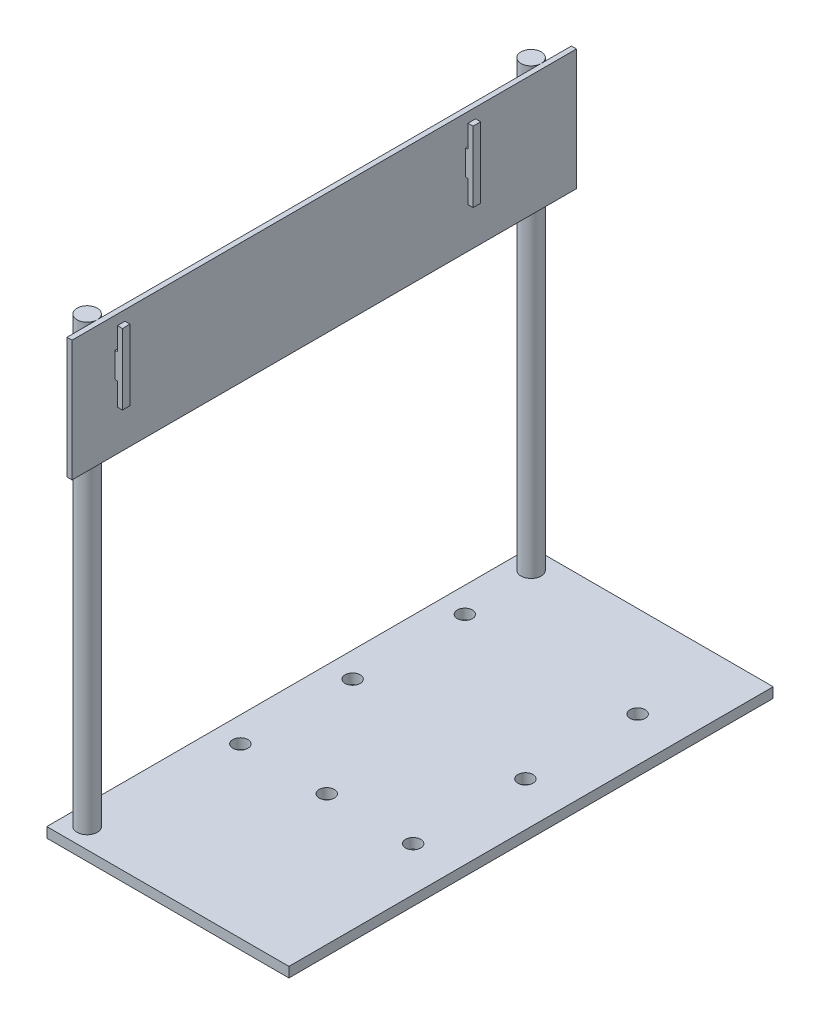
ISO-10303-21;
HEADER;
FILE_DESCRIPTION(('STEP AP214'),'2;1');
FILE_NAME('part.step','',(''),(''),'','','');
FILE_SCHEMA(('AUTOMOTIVE_DESIGN { 1 0 10303 214 1 1 1 1 }'));
ENDSEC;
DATA;
#1=APPLICATION_CONTEXT('core data for automotive mechanical design processes');
#2=APPLICATION_PROTOCOL_DEFINITION('international standard','automotive_design',2000,#1);
#3=PRODUCT_CONTEXT('',#1,'mechanical');
#4=PRODUCT('Part','Part','',(#3));
#5=PRODUCT_RELATED_PRODUCT_CATEGORY('part','',(#4));
#6=PRODUCT_DEFINITION_FORMATION('','',#4);
#7=PRODUCT_DEFINITION_CONTEXT('part definition',#1,'design');
#8=PRODUCT_DEFINITION('design','',#6,#7);
#9=PRODUCT_DEFINITION_SHAPE('','',#8);
#10=(LENGTH_UNIT() NAMED_UNIT(*) SI_UNIT(.MILLI.,.METRE.));
#11=(NAMED_UNIT(*) PLANE_ANGLE_UNIT() SI_UNIT($,.RADIAN.));
#12=(NAMED_UNIT(*) SI_UNIT($,.STERADIAN.) SOLID_ANGLE_UNIT());
#13=UNCERTAINTY_MEASURE_WITH_UNIT(LENGTH_MEASURE(1.E-05),#10,'distance_accuracy_value','');
#14=(GEOMETRIC_REPRESENTATION_CONTEXT(3) GLOBAL_UNCERTAINTY_ASSIGNED_CONTEXT((#13)) GLOBAL_UNIT_ASSIGNED_CONTEXT((#10,
#11,#12)) REPRESENTATION_CONTEXT('',''));
#15=CARTESIAN_POINT('',(0.,0.,0.));
#16=DIRECTION('',(0.,0.,1.));
#17=DIRECTION('',(1.,0.,0.));
#18=AXIS2_PLACEMENT_3D('',#15,#16,#17);
#19=CARTESIAN_POINT('',(-215.9,0.,0.));
#20=DIRECTION('',(-1.,0.,0.));
#21=DIRECTION('',(0.,0.,1.));
#22=AXIS2_PLACEMENT_3D('',#19,#20,#21);
#23=PLANE('',#22);
#24=DIRECTION('',(0.,0.,-1.));
#25=VECTOR('',#24,1.);
#26=CARTESIAN_POINT('',(-215.9,1066.8,0.));
#27=LINE('',#26,#25);
#28=CARTESIAN_POINT('',(-215.9,1066.8,-355.6));
#29=VERTEX_POINT('',#28);
#30=CARTESIAN_POINT('',(-215.9,1066.8,-374.65));
#31=VERTEX_POINT('',#30);
#32=EDGE_CURVE('E61',#29,#31,#27,.T.);
#33=ORIENTED_EDGE('',*,*,#32,.T.);
#34=DIRECTION('',(0.,-1.,0.));
#35=VECTOR('',#34,1.);
#36=CARTESIAN_POINT('',(-215.9,0.,-374.65));
#37=LINE('',#36,#35);
#38=CARTESIAN_POINT('',(-215.9,1003.3,-374.65));
#39=VERTEX_POINT('',#38);
#40=EDGE_CURVE('E65',#31,#39,#37,.T.);
#41=ORIENTED_EDGE('',*,*,#40,.T.);
#42=DIRECTION('',(0.,0.,1.));
#43=VECTOR('',#42,1.);
#44=CARTESIAN_POINT('',(-215.9,1003.3,0.));
#45=LINE('',#44,#43);
#46=CARTESIAN_POINT('',(-215.9,1003.3,-355.6));
#47=VERTEX_POINT('',#46);
#48=EDGE_CURVE('E186',#39,#47,#45,.T.);
#49=ORIENTED_EDGE('',*,*,#48,.T.);
#50=DIRECTION('',(0.,-1.,0.));
#51=VECTOR('',#50,1.);
#52=CARTESIAN_POINT('',(-215.9,0.,-355.6));
#53=LINE('',#52,#51);
#54=EDGE_CURVE('E238',#29,#47,#53,.T.);
#55=ORIENTED_EDGE('',*,*,#54,.F.);
#56=EDGE_LOOP('',(#33,#41,#49,#55));
#57=FACE_BOUND('',#56,.T.);
#58=DIRECTION('',(0.,-1.,0.));
#59=VECTOR('',#58,1.);
#60=CARTESIAN_POINT('',(-215.9,1143.,-635.));
#61=LINE('',#60,#59);
#62=CARTESIAN_POINT('',(-215.9,1143.,-635.));
#63=VERTEX_POINT('',#62);
#64=CARTESIAN_POINT('',(-215.9,838.2,-635.));
#65=VERTEX_POINT('',#64);
#66=EDGE_CURVE('E310',#63,#65,#61,.T.);
#67=ORIENTED_EDGE('',*,*,#66,.F.);
#68=DIRECTION('',(0.,0.,-1.));
#69=VECTOR('',#68,1.);
#70=CARTESIAN_POINT('',(-215.9,1143.,-635.));
#71=LINE('',#70,#69);
#72=CARTESIAN_POINT('',(-215.9,1143.,635.));
#73=VERTEX_POINT('',#72);
#74=EDGE_CURVE('E320',#73,#63,#71,.T.);
#75=ORIENTED_EDGE('',*,*,#74,.F.);
#76=DIRECTION('',(0.,1.,0.));
#77=VECTOR('',#76,1.);
#78=CARTESIAN_POINT('',(-215.9,1143.,635.));
#79=LINE('',#78,#77);
#80=CARTESIAN_POINT('',(-215.9,838.2,635.));
#81=VERTEX_POINT('',#80);
#82=EDGE_CURVE('E317',#81,#73,#79,.T.);
#83=ORIENTED_EDGE('',*,*,#82,.F.);
#84=DIRECTION('',(0.,0.,1.));
#85=VECTOR('',#84,1.);
#86=CARTESIAN_POINT('',(-215.9,838.2,-635.));
#87=LINE('',#86,#85);
#88=EDGE_CURVE('E313',#65,#81,#87,.T.);
#89=ORIENTED_EDGE('',*,*,#88,.F.);
#90=EDGE_LOOP('',(#67,#75,#83,#89));
#91=FACE_BOUND('',#90,.T.);
#92=DIRECTION('',(0.,-1.,0.));
#93=VECTOR('',#92,1.);
#94=CARTESIAN_POINT('',(-215.9,0.,527.05));
#95=LINE('',#94,#93);
#96=CARTESIAN_POINT('',(-215.9,1066.8,527.05));
#97=VERTEX_POINT('',#96);
#98=CARTESIAN_POINT('',(-215.9,1003.3,527.05));
#99=VERTEX_POINT('',#98);
#100=EDGE_CURVE('E302',#97,#99,#95,.T.);
#101=ORIENTED_EDGE('',*,*,#100,.F.);
#102=DIRECTION('',(0.,0.,1.));
#103=VECTOR('',#102,1.);
#104=CARTESIAN_POINT('',(-215.9,1066.8,0.));
#105=LINE('',#104,#103);
#106=CARTESIAN_POINT('',(-215.9,1066.8,508.));
#107=VERTEX_POINT('',#106);
#108=EDGE_CURVE('E304',#107,#97,#105,.T.);
#109=ORIENTED_EDGE('',*,*,#108,.F.);
#110=DIRECTION('',(0.,-1.,0.));
#111=VECTOR('',#110,1.);
#112=CARTESIAN_POINT('',(-215.9,0.,508.));
#113=LINE('',#112,#111);
#114=CARTESIAN_POINT('',(-215.9,1003.3,508.));
#115=VERTEX_POINT('',#114);
#116=EDGE_CURVE('E299',#107,#115,#113,.T.);
#117=ORIENTED_EDGE('',*,*,#116,.T.);
#118=DIRECTION('',(0.,0.,-1.));
#119=VECTOR('',#118,1.);
#120=CARTESIAN_POINT('',(-215.9,1003.3,0.));
#121=LINE('',#120,#119);
#122=EDGE_CURVE('E306',#99,#115,#121,.T.);
#123=ORIENTED_EDGE('',*,*,#122,.F.);
#124=EDGE_LOOP('',(#101,#109,#117,#123));
#125=FACE_BOUND('',#124,.T.);
#126=ADVANCED_FACE('F44',(#57,#91,#125),#23,.F.);
#127=CARTESIAN_POINT('',(-215.9,1143.,-635.));
#128=DIRECTION('',(0.,0.,-1.));
#129=DIRECTION('',(-1.,0.,0.));
#130=AXIS2_PLACEMENT_3D('',#127,#128,#129);
#131=PLANE('',#130);
#132=DIRECTION('',(0.,-1.,0.));
#133=VECTOR('',#132,1.);
#134=CARTESIAN_POINT('',(-228.6,1143.,-635.));
#135=LINE('',#134,#133);
#136=CARTESIAN_POINT('',(-228.6,1143.,-635.));
#137=VERTEX_POINT('',#136);
#138=CARTESIAN_POINT('',(-228.6,838.2,-635.));
#139=VERTEX_POINT('',#138);
#140=EDGE_CURVE('E309',#137,#139,#135,.T.);
#141=ORIENTED_EDGE('',*,*,#140,.F.);
#142=DIRECTION('',(-1.,0.,0.));
#143=VECTOR('',#142,1.);
#144=CARTESIAN_POINT('',(-215.9,1143.,-635.));
#145=LINE('',#144,#143);
#146=EDGE_CURVE('E12',#63,#137,#145,.T.);
#147=ORIENTED_EDGE('',*,*,#146,.F.);
#148=ORIENTED_EDGE('',*,*,#66,.T.);
#149=DIRECTION('',(-1.,0.,0.));
#150=VECTOR('',#149,1.);
#151=CARTESIAN_POINT('',(-215.9,838.2,-635.));
#152=LINE('',#151,#150);
#153=EDGE_CURVE('E48',#65,#139,#152,.T.);
#154=ORIENTED_EDGE('',*,*,#153,.T.);
#155=EDGE_LOOP('',(#141,#147,#148,#154));
#156=FACE_BOUND('',#155,.T.);
#157=ADVANCED_FACE('F46',(#156),#131,.T.);
#158=CARTESIAN_POINT('',(-215.9,1143.,-635.));
#159=DIRECTION('',(0.,1.,0.));
#160=DIRECTION('',(0.,0.,1.));
#161=AXIS2_PLACEMENT_3D('',#158,#159,#160);
#162=PLANE('',#161);
#163=DIRECTION('',(0.,0.,-1.));
#164=VECTOR('',#163,1.);
#165=CARTESIAN_POINT('',(-228.6,1143.,-635.));
#166=LINE('',#165,#164);
#167=CARTESIAN_POINT('',(-228.6,1143.,635.));
#168=VERTEX_POINT('',#167);
#169=EDGE_CURVE('E314',#168,#137,#166,.T.);
#170=ORIENTED_EDGE('',*,*,#169,.F.);
#171=DIRECTION('',(-1.,0.,0.));
#172=VECTOR('',#171,1.);
#173=CARTESIAN_POINT('',(-215.9,1143.,635.));
#174=LINE('',#173,#172);
#175=EDGE_CURVE('E53',#73,#168,#174,.T.);
#176=ORIENTED_EDGE('',*,*,#175,.F.);
#177=ORIENTED_EDGE('',*,*,#74,.T.);
#178=ORIENTED_EDGE('',*,*,#146,.T.);
#179=EDGE_LOOP('',(#170,#176,#177,#178));
#180=FACE_BOUND('',#179,.T.);
#181=ADVANCED_FACE('F346',(#180),#162,.T.);
#182=CARTESIAN_POINT('',(-215.9,1143.,635.));
#183=DIRECTION('',(0.,0.,1.));
#184=DIRECTION('',(1.,0.,0.));
#185=AXIS2_PLACEMENT_3D('',#182,#183,#184);
#186=PLANE('',#185);
#187=DIRECTION('',(0.,1.,0.));
#188=VECTOR('',#187,1.);
#189=CARTESIAN_POINT('',(-228.6,1143.,635.));
#190=LINE('',#189,#188);
#191=CARTESIAN_POINT('',(-228.6,838.2,635.));
#192=VERTEX_POINT('',#191);
#193=EDGE_CURVE('E328',#192,#168,#190,.T.);
#194=ORIENTED_EDGE('',*,*,#193,.F.);
#195=DIRECTION('',(-1.,0.,0.));
#196=VECTOR('',#195,1.);
#197=CARTESIAN_POINT('',(-215.9,838.2,635.));
#198=LINE('',#197,#196);
#199=EDGE_CURVE('E333',#81,#192,#198,.T.);
#200=ORIENTED_EDGE('',*,*,#199,.F.);
#201=ORIENTED_EDGE('',*,*,#82,.T.);
#202=ORIENTED_EDGE('',*,*,#175,.T.);
#203=EDGE_LOOP('',(#194,#200,#201,#202));
#204=FACE_BOUND('',#203,.T.);
#205=ADVANCED_FACE('F352',(#204),#186,.T.);
#206=CARTESIAN_POINT('',(-215.9,838.2,-635.));
#207=DIRECTION('',(0.,-1.,0.));
#208=DIRECTION('',(0.,0.,-1.));
#209=AXIS2_PLACEMENT_3D('',#206,#207,#208);
#210=PLANE('',#209);
#211=DIRECTION('',(0.,0.,1.));
#212=VECTOR('',#211,1.);
#213=CARTESIAN_POINT('',(-228.6,838.2,-635.));
#214=LINE('',#213,#212);
#215=EDGE_CURVE('E325',#139,#192,#214,.T.);
#216=ORIENTED_EDGE('',*,*,#215,.F.);
#217=ORIENTED_EDGE('',*,*,#153,.F.);
#218=ORIENTED_EDGE('',*,*,#88,.T.);
#219=ORIENTED_EDGE('',*,*,#199,.T.);
#220=EDGE_LOOP('',(#216,#217,#218,#219));
#221=FACE_BOUND('',#220,.T.);
#222=ADVANCED_FACE('F341',(#221),#210,.T.);
#223=CARTESIAN_POINT('',(-228.6,0.,0.));
#224=DIRECTION('',(-1.,0.,0.));
#225=DIRECTION('',(0.,0.,1.));
#226=AXIS2_PLACEMENT_3D('',#223,#224,#225);
#227=PLANE('',#226);
#228=ORIENTED_EDGE('',*,*,#140,.T.);
#229=ORIENTED_EDGE('',*,*,#215,.T.);
#230=ORIENTED_EDGE('',*,*,#193,.T.);
#231=ORIENTED_EDGE('',*,*,#169,.T.);
#232=EDGE_LOOP('',(#228,#229,#230,#231));
#233=FACE_BOUND('',#232,.T.);
#234=ADVANCED_FACE('F343',(#233),#227,.T.);
#235=CARTESIAN_POINT('',(-209.55,1003.3,527.05));
#236=DIRECTION('',(0.,1.,0.));
#237=DIRECTION('',(0.,0.,1.));
#238=AXIS2_PLACEMENT_3D('',#235,#236,#237);
#239=PLANE('',#238);
#240=DIRECTION('',(1.,0.,0.));
#241=VECTOR('',#240,1.);
#242=CARTESIAN_POINT('',(-209.55,1003.3,527.05));
#243=LINE('',#242,#241);
#244=CARTESIAN_POINT('',(-209.55,1003.3,527.05));
#245=VERTEX_POINT('',#244);
#246=EDGE_CURVE('E252',#99,#245,#243,.T.);
#247=ORIENTED_EDGE('',*,*,#246,.F.);
#248=ORIENTED_EDGE('',*,*,#122,.T.);
#249=DIRECTION('',(1.,0.,0.));
#250=VECTOR('',#249,1.);
#251=CARTESIAN_POINT('',(-209.55,1003.3,508.));
#252=LINE('',#251,#250);
#253=CARTESIAN_POINT('',(-209.55,1003.3,508.));
#254=VERTEX_POINT('',#253);
#255=EDGE_CURVE('E251',#115,#254,#252,.T.);
#256=ORIENTED_EDGE('',*,*,#255,.T.);
#257=DIRECTION('',(0.,0.,-1.));
#258=VECTOR('',#257,1.);
#259=CARTESIAN_POINT('',(-209.55,1003.3,527.05));
#260=LINE('',#259,#258);
#261=EDGE_CURVE('E296',#245,#254,#260,.T.);
#262=ORIENTED_EDGE('',*,*,#261,.F.);
#263=EDGE_LOOP('',(#247,#248,#256,#262));
#264=FACE_BOUND('',#263,.T.);
#265=ADVANCED_FACE('F367',(#264),#239,.F.);
#266=CARTESIAN_POINT('',(-228.6,1066.8,527.05));
#267=DIRECTION('',(0.,-1.,0.));
#268=DIRECTION('',(1.,0.,0.));
#269=AXIS2_PLACEMENT_3D('',#266,#267,#268);
#270=PLANE('',#269);
#271=DIRECTION('',(-1.,0.,0.));
#272=VECTOR('',#271,1.);
#273=CARTESIAN_POINT('',(-228.6,1066.8,508.));
#274=LINE('',#273,#272);
#275=CARTESIAN_POINT('',(-209.55,1066.8,508.));
#276=VERTEX_POINT('',#275);
#277=EDGE_CURVE('E255',#276,#107,#274,.T.);
#278=ORIENTED_EDGE('',*,*,#277,.T.);
#279=ORIENTED_EDGE('',*,*,#108,.T.);
#280=DIRECTION('',(-1.,0.,0.));
#281=VECTOR('',#280,1.);
#282=CARTESIAN_POINT('',(-228.6,1066.8,527.05));
#283=LINE('',#282,#281);
#284=CARTESIAN_POINT('',(-209.55,1066.8,527.05));
#285=VERTEX_POINT('',#284);
#286=EDGE_CURVE('E265',#285,#97,#283,.T.);
#287=ORIENTED_EDGE('',*,*,#286,.F.);
#288=DIRECTION('',(0.,0.,-1.));
#289=VECTOR('',#288,1.);
#290=CARTESIAN_POINT('',(-209.55,1066.8,527.05));
#291=LINE('',#290,#289);
#292=EDGE_CURVE('E268',#285,#276,#291,.T.);
#293=ORIENTED_EDGE('',*,*,#292,.T.);
#294=EDGE_LOOP('',(#278,#279,#287,#293));
#295=FACE_BOUND('',#294,.T.);
#296=ADVANCED_FACE('F373',(#295),#270,.F.);
#297=CARTESIAN_POINT('',(0.,0.,527.05));
#298=DIRECTION('',(0.,0.,-1.));
#299=DIRECTION('',(-1.,0.,0.));
#300=AXIS2_PLACEMENT_3D('',#297,#298,#299);
#301=PLANE('',#300);
#302=ORIENTED_EDGE('',*,*,#286,.T.);
#303=ORIENTED_EDGE('',*,*,#100,.T.);
#304=ORIENTED_EDGE('',*,*,#246,.T.);
#305=DIRECTION('',(0.,-1.,0.));
#306=VECTOR('',#305,1.);
#307=CARTESIAN_POINT('',(-209.55,946.15,527.05));
#308=LINE('',#307,#306);
#309=CARTESIAN_POINT('',(-209.55,946.15,527.05));
#310=VERTEX_POINT('',#309);
#311=EDGE_CURVE('E254',#245,#310,#308,.T.);
#312=ORIENTED_EDGE('',*,*,#311,.T.);
#313=DIRECTION('',(1.,0.,0.));
#314=VECTOR('',#313,1.);
#315=CARTESIAN_POINT('',(-196.85,946.15,527.05));
#316=LINE('',#315,#314);
#317=CARTESIAN_POINT('',(-196.85,946.15,527.05));
#318=VERTEX_POINT('',#317);
#319=EDGE_CURVE('E257',#310,#318,#316,.T.);
#320=ORIENTED_EDGE('',*,*,#319,.T.);
#321=DIRECTION('',(0.,1.,0.));
#322=VECTOR('',#321,1.);
#323=CARTESIAN_POINT('',(-196.85,1123.95,527.05));
#324=LINE('',#323,#322);
#325=CARTESIAN_POINT('',(-196.85,1123.95,527.05));
#326=VERTEX_POINT('',#325);
#327=EDGE_CURVE('E259',#318,#326,#324,.T.);
#328=ORIENTED_EDGE('',*,*,#327,.T.);
#329=DIRECTION('',(-1.,0.,0.));
#330=VECTOR('',#329,1.);
#331=CARTESIAN_POINT('',(-209.55,1123.95,527.05));
#332=LINE('',#331,#330);
#333=CARTESIAN_POINT('',(-209.55,1123.95,527.05));
#334=VERTEX_POINT('',#333);
#335=EDGE_CURVE('E261',#326,#334,#332,.T.);
#336=ORIENTED_EDGE('',*,*,#335,.T.);
#337=DIRECTION('',(0.,-1.,0.));
#338=VECTOR('',#337,1.);
#339=CARTESIAN_POINT('',(-209.55,1066.8,527.05));
#340=LINE('',#339,#338);
#341=EDGE_CURVE('E263',#334,#285,#340,.T.);
#342=ORIENTED_EDGE('',*,*,#341,.T.);
#343=EDGE_LOOP('',(#302,#303,#304,#312,#320,#328,#336,#342));
#344=FACE_BOUND('',#343,.T.);
#345=ADVANCED_FACE('F378',(#344),#301,.F.);
#346=CARTESIAN_POINT('',(0.,0.,508.));
#347=DIRECTION('',(0.,0.,-1.));
#348=DIRECTION('',(-1.,0.,0.));
#349=AXIS2_PLACEMENT_3D('',#346,#347,#348);
#350=PLANE('',#349);
#351=ORIENTED_EDGE('',*,*,#116,.F.);
#352=ORIENTED_EDGE('',*,*,#277,.F.);
#353=DIRECTION('',(0.,-1.,0.));
#354=VECTOR('',#353,1.);
#355=CARTESIAN_POINT('',(-209.55,1066.8,508.));
#356=LINE('',#355,#354);
#357=CARTESIAN_POINT('',(-209.55,1123.95,508.));
#358=VERTEX_POINT('',#357);
#359=EDGE_CURVE('E278',#358,#276,#356,.T.);
#360=ORIENTED_EDGE('',*,*,#359,.F.);
#361=DIRECTION('',(-1.,0.,0.));
#362=VECTOR('',#361,1.);
#363=CARTESIAN_POINT('',(-209.55,1123.95,508.));
#364=LINE('',#363,#362);
#365=CARTESIAN_POINT('',(-196.85,1123.95,508.));
#366=VERTEX_POINT('',#365);
#367=EDGE_CURVE('E276',#366,#358,#364,.T.);
#368=ORIENTED_EDGE('',*,*,#367,.F.);
#369=DIRECTION('',(0.,1.,0.));
#370=VECTOR('',#369,1.);
#371=CARTESIAN_POINT('',(-196.85,1123.95,508.));
#372=LINE('',#371,#370);
#373=CARTESIAN_POINT('',(-196.85,946.15,508.));
#374=VERTEX_POINT('',#373);
#375=EDGE_CURVE('E274',#374,#366,#372,.T.);
#376=ORIENTED_EDGE('',*,*,#375,.F.);
#377=DIRECTION('',(1.,0.,0.));
#378=VECTOR('',#377,1.);
#379=CARTESIAN_POINT('',(-196.85,946.15,508.));
#380=LINE('',#379,#378);
#381=CARTESIAN_POINT('',(-209.55,946.15,508.));
#382=VERTEX_POINT('',#381);
#383=EDGE_CURVE('E272',#382,#374,#380,.T.);
#384=ORIENTED_EDGE('',*,*,#383,.F.);
#385=DIRECTION('',(0.,-1.,0.));
#386=VECTOR('',#385,1.);
#387=CARTESIAN_POINT('',(-209.55,946.15,508.));
#388=LINE('',#387,#386);
#389=EDGE_CURVE('E270',#254,#382,#388,.T.);
#390=ORIENTED_EDGE('',*,*,#389,.F.);
#391=ORIENTED_EDGE('',*,*,#255,.F.);
#392=EDGE_LOOP('',(#351,#352,#360,#368,#376,#384,#390,#391));
#393=FACE_BOUND('',#392,.T.);
#394=ADVANCED_FACE('F390',(#393),#350,.T.);
#395=CARTESIAN_POINT('',(-209.55,946.15,527.05));
#396=DIRECTION('',(1.,0.,0.));
#397=DIRECTION('',(0.,0.,-1.));
#398=AXIS2_PLACEMENT_3D('',#395,#396,#397);
#399=PLANE('',#398);
#400=ORIENTED_EDGE('',*,*,#389,.T.);
#401=DIRECTION('',(0.,0.,-1.));
#402=VECTOR('',#401,1.);
#403=CARTESIAN_POINT('',(-209.55,946.15,527.05));
#404=LINE('',#403,#402);
#405=EDGE_CURVE('E293',#310,#382,#404,.T.);
#406=ORIENTED_EDGE('',*,*,#405,.F.);
#407=ORIENTED_EDGE('',*,*,#311,.F.);
#408=ORIENTED_EDGE('',*,*,#261,.T.);
#409=EDGE_LOOP('',(#400,#406,#407,#408));
#410=FACE_BOUND('',#409,.T.);
#411=ADVANCED_FACE('F415',(#410),#399,.F.);
#412=CARTESIAN_POINT('',(-196.85,946.15,527.05));
#413=DIRECTION('',(0.,1.,0.));
#414=DIRECTION('',(0.,0.,1.));
#415=AXIS2_PLACEMENT_3D('',#412,#413,#414);
#416=PLANE('',#415);
#417=ORIENTED_EDGE('',*,*,#383,.T.);
#418=DIRECTION('',(0.,0.,-1.));
#419=VECTOR('',#418,1.);
#420=CARTESIAN_POINT('',(-196.85,946.15,527.05));
#421=LINE('',#420,#419);
#422=EDGE_CURVE('E290',#318,#374,#421,.T.);
#423=ORIENTED_EDGE('',*,*,#422,.F.);
#424=ORIENTED_EDGE('',*,*,#319,.F.);
#425=ORIENTED_EDGE('',*,*,#405,.T.);
#426=EDGE_LOOP('',(#417,#423,#424,#425));
#427=FACE_BOUND('',#426,.T.);
#428=ADVANCED_FACE('F412',(#427),#416,.F.);
#429=CARTESIAN_POINT('',(-196.85,1123.95,527.05));
#430=DIRECTION('',(-1.,0.,0.));
#431=DIRECTION('',(0.,0.,1.));
#432=AXIS2_PLACEMENT_3D('',#429,#430,#431);
#433=PLANE('',#432);
#434=ORIENTED_EDGE('',*,*,#375,.T.);
#435=DIRECTION('',(0.,0.,-1.));
#436=VECTOR('',#435,1.);
#437=CARTESIAN_POINT('',(-196.85,1123.95,527.05));
#438=LINE('',#437,#436);
#439=EDGE_CURVE('E287',#326,#366,#438,.T.);
#440=ORIENTED_EDGE('',*,*,#439,.F.);
#441=ORIENTED_EDGE('',*,*,#327,.F.);
#442=ORIENTED_EDGE('',*,*,#422,.T.);
#443=EDGE_LOOP('',(#434,#440,#441,#442));
#444=FACE_BOUND('',#443,.T.);
#445=ADVANCED_FACE('F408',(#444),#433,.F.);
#446=CARTESIAN_POINT('',(-209.55,1123.95,527.05));
#447=DIRECTION('',(0.,-1.,0.));
#448=DIRECTION('',(0.,0.,-1.));
#449=AXIS2_PLACEMENT_3D('',#446,#447,#448);
#450=PLANE('',#449);
#451=ORIENTED_EDGE('',*,*,#367,.T.);
#452=DIRECTION('',(0.,0.,-1.));
#453=VECTOR('',#452,1.);
#454=CARTESIAN_POINT('',(-209.55,1123.95,527.05));
#455=LINE('',#454,#453);
#456=EDGE_CURVE('E284',#334,#358,#455,.T.);
#457=ORIENTED_EDGE('',*,*,#456,.F.);
#458=ORIENTED_EDGE('',*,*,#335,.F.);
#459=ORIENTED_EDGE('',*,*,#439,.T.);
#460=EDGE_LOOP('',(#451,#457,#458,#459));
#461=FACE_BOUND('',#460,.T.);
#462=ADVANCED_FACE('F403',(#461),#450,.F.);
#463=CARTESIAN_POINT('',(-209.55,1066.8,527.05));
#464=DIRECTION('',(1.,0.,0.));
#465=DIRECTION('',(0.,0.,-1.));
#466=AXIS2_PLACEMENT_3D('',#463,#464,#465);
#467=PLANE('',#466);
#468=ORIENTED_EDGE('',*,*,#359,.T.);
#469=ORIENTED_EDGE('',*,*,#292,.F.);
#470=ORIENTED_EDGE('',*,*,#341,.F.);
#471=ORIENTED_EDGE('',*,*,#456,.T.);
#472=EDGE_LOOP('',(#468,#469,#470,#471));
#473=FACE_BOUND('',#472,.T.);
#474=ADVANCED_FACE('F397',(#473),#467,.F.);
#475=CARTESIAN_POINT('',(-228.6,1066.8,-374.65));
#476=DIRECTION('',(0.,1.,0.));
#477=DIRECTION('',(-1.,0.,0.));
#478=AXIS2_PLACEMENT_3D('',#475,#476,#477);
#479=PLANE('',#478);
#480=ORIENTED_EDGE('',*,*,#32,.F.);
#481=DIRECTION('',(-1.,0.,0.));
#482=VECTOR('',#481,1.);
#483=CARTESIAN_POINT('',(-228.6,1066.8,-355.6));
#484=LINE('',#483,#482);
#485=CARTESIAN_POINT('',(-209.55,1066.8,-355.6));
#486=VERTEX_POINT('',#485);
#487=EDGE_CURVE('E190',#486,#29,#484,.T.);
#488=ORIENTED_EDGE('',*,*,#487,.F.);
#489=DIRECTION('',(0.,0.,1.));
#490=VECTOR('',#489,1.);
#491=CARTESIAN_POINT('',(-209.55,1066.8,-374.65));
#492=LINE('',#491,#490);
#493=CARTESIAN_POINT('',(-209.55,1066.8,-374.65));
#494=VERTEX_POINT('',#493);
#495=EDGE_CURVE('E236',#494,#486,#492,.T.);
#496=ORIENTED_EDGE('',*,*,#495,.F.);
#497=DIRECTION('',(-1.,0.,0.));
#498=VECTOR('',#497,1.);
#499=CARTESIAN_POINT('',(-228.6,1066.8,-374.65));
#500=LINE('',#499,#498);
#501=EDGE_CURVE('E198',#494,#31,#500,.T.);
#502=ORIENTED_EDGE('',*,*,#501,.T.);
#503=EDGE_LOOP('',(#480,#488,#496,#502));
#504=FACE_BOUND('',#503,.T.);
#505=ADVANCED_FACE('F427',(#504),#479,.T.);
#506=CARTESIAN_POINT('',(-209.55,1003.3,-374.65));
#507=DIRECTION('',(0.,-1.,0.));
#508=DIRECTION('',(0.,0.,-1.));
#509=AXIS2_PLACEMENT_3D('',#506,#507,#508);
#510=PLANE('',#509);
#511=ORIENTED_EDGE('',*,*,#48,.F.);
#512=DIRECTION('',(1.,0.,0.));
#513=VECTOR('',#512,1.);
#514=CARTESIAN_POINT('',(-209.55,1003.3,-374.65));
#515=LINE('',#514,#513);
#516=CARTESIAN_POINT('',(-209.55,1003.3,-374.65));
#517=VERTEX_POINT('',#516);
#518=EDGE_CURVE('E180',#39,#517,#515,.T.);
#519=ORIENTED_EDGE('',*,*,#518,.T.);
#520=DIRECTION('',(0.,0.,1.));
#521=VECTOR('',#520,1.);
#522=CARTESIAN_POINT('',(-209.55,1003.3,-374.65));
#523=LINE('',#522,#521);
#524=CARTESIAN_POINT('',(-209.55,1003.3,-355.6));
#525=VERTEX_POINT('',#524);
#526=EDGE_CURVE('E184',#517,#525,#523,.T.);
#527=ORIENTED_EDGE('',*,*,#526,.T.);
#528=DIRECTION('',(1.,0.,0.));
#529=VECTOR('',#528,1.);
#530=CARTESIAN_POINT('',(-209.55,1003.3,-355.6));
#531=LINE('',#530,#529);
#532=EDGE_CURVE('E219',#47,#525,#531,.T.);
#533=ORIENTED_EDGE('',*,*,#532,.F.);
#534=EDGE_LOOP('',(#511,#519,#527,#533));
#535=FACE_BOUND('',#534,.T.);
#536=ADVANCED_FACE('F182',(#535),#510,.T.);
#537=CARTESIAN_POINT('',(0.,0.,-374.65));
#538=DIRECTION('',(0.,0.,-1.));
#539=DIRECTION('',(-1.,0.,0.));
#540=AXIS2_PLACEMENT_3D('',#537,#538,#539);
#541=PLANE('',#540);
#542=ORIENTED_EDGE('',*,*,#40,.F.);
#543=ORIENTED_EDGE('',*,*,#501,.F.);
#544=DIRECTION('',(0.,-1.,0.));
#545=VECTOR('',#544,1.);
#546=CARTESIAN_POINT('',(-209.55,1066.8,-374.65));
#547=LINE('',#546,#545);
#548=CARTESIAN_POINT('',(-209.55,1123.95,-374.65));
#549=VERTEX_POINT('',#548);
#550=EDGE_CURVE('E214',#549,#494,#547,.T.);
#551=ORIENTED_EDGE('',*,*,#550,.F.);
#552=DIRECTION('',(-1.,0.,0.));
#553=VECTOR('',#552,1.);
#554=CARTESIAN_POINT('',(-209.55,1123.95,-374.65));
#555=LINE('',#554,#553);
#556=CARTESIAN_POINT('',(-196.85,1123.95,-374.65));
#557=VERTEX_POINT('',#556);
#558=EDGE_CURVE('E211',#557,#549,#555,.T.);
#559=ORIENTED_EDGE('',*,*,#558,.F.);
#560=DIRECTION('',(0.,1.,0.));
#561=VECTOR('',#560,1.);
#562=CARTESIAN_POINT('',(-196.85,1123.95,-374.65));
#563=LINE('',#562,#561);
#564=CARTESIAN_POINT('',(-196.85,946.15,-374.65));
#565=VERTEX_POINT('',#564);
#566=EDGE_CURVE('E206',#565,#557,#563,.T.);
#567=ORIENTED_EDGE('',*,*,#566,.F.);
#568=DIRECTION('',(1.,0.,0.));
#569=VECTOR('',#568,1.);
#570=CARTESIAN_POINT('',(-196.85,946.15,-374.65));
#571=LINE('',#570,#569);
#572=CARTESIAN_POINT('',(-209.55,946.15,-374.65));
#573=VERTEX_POINT('',#572);
#574=EDGE_CURVE('E204',#573,#565,#571,.T.);
#575=ORIENTED_EDGE('',*,*,#574,.F.);
#576=DIRECTION('',(0.,-1.,0.));
#577=VECTOR('',#576,1.);
#578=CARTESIAN_POINT('',(-209.55,946.15,-374.65));
#579=LINE('',#578,#577);
#580=EDGE_CURVE('E189',#517,#573,#579,.T.);
#581=ORIENTED_EDGE('',*,*,#580,.F.);
#582=ORIENTED_EDGE('',*,*,#518,.F.);
#583=EDGE_LOOP('',(#542,#543,#551,#559,#567,#575,#581,#582));
#584=FACE_BOUND('',#583,.T.);
#585=ADVANCED_FACE('F201',(#584),#541,.T.);
#586=CARTESIAN_POINT('',(0.,0.,-355.6));
#587=DIRECTION('',(0.,0.,-1.));
#588=DIRECTION('',(-1.,0.,0.));
#589=AXIS2_PLACEMENT_3D('',#586,#587,#588);
#590=PLANE('',#589);
#591=ORIENTED_EDGE('',*,*,#487,.T.);
#592=ORIENTED_EDGE('',*,*,#54,.T.);
#593=ORIENTED_EDGE('',*,*,#532,.T.);
#594=DIRECTION('',(0.,-1.,0.));
#595=VECTOR('',#594,1.);
#596=CARTESIAN_POINT('',(-209.55,946.15,-355.6));
#597=LINE('',#596,#595);
#598=CARTESIAN_POINT('',(-209.55,946.15,-355.6));
#599=VERTEX_POINT('',#598);
#600=EDGE_CURVE('E196',#525,#599,#597,.T.);
#601=ORIENTED_EDGE('',*,*,#600,.T.);
#602=DIRECTION('',(1.,0.,0.));
#603=VECTOR('',#602,1.);
#604=CARTESIAN_POINT('',(-196.85,946.15,-355.6));
#605=LINE('',#604,#603);
#606=CARTESIAN_POINT('',(-196.85,946.15,-355.6));
#607=VERTEX_POINT('',#606);
#608=EDGE_CURVE('E222',#599,#607,#605,.T.);
#609=ORIENTED_EDGE('',*,*,#608,.T.);
#610=DIRECTION('',(0.,1.,0.));
#611=VECTOR('',#610,1.);
#612=CARTESIAN_POINT('',(-196.85,1123.95,-355.6));
#613=LINE('',#612,#611);
#614=CARTESIAN_POINT('',(-196.85,1123.95,-355.6));
#615=VERTEX_POINT('',#614);
#616=EDGE_CURVE('E225',#607,#615,#613,.T.);
#617=ORIENTED_EDGE('',*,*,#616,.T.);
#618=DIRECTION('',(-1.,0.,0.));
#619=VECTOR('',#618,1.);
#620=CARTESIAN_POINT('',(-209.55,1123.95,-355.6));
#621=LINE('',#620,#619);
#622=CARTESIAN_POINT('',(-209.55,1123.95,-355.6));
#623=VERTEX_POINT('',#622);
#624=EDGE_CURVE('E228',#615,#623,#621,.T.);
#625=ORIENTED_EDGE('',*,*,#624,.T.);
#626=DIRECTION('',(0.,-1.,0.));
#627=VECTOR('',#626,1.);
#628=CARTESIAN_POINT('',(-209.55,1066.8,-355.6));
#629=LINE('',#628,#627);
#630=EDGE_CURVE('E231',#623,#486,#629,.T.);
#631=ORIENTED_EDGE('',*,*,#630,.T.);
#632=EDGE_LOOP('',(#591,#592,#593,#601,#609,#617,#625,#631));
#633=FACE_BOUND('',#632,.T.);
#634=ADVANCED_FACE('F472',(#633),#590,.F.);
#635=CARTESIAN_POINT('',(-209.55,1066.8,-374.65));
#636=DIRECTION('',(-1.,0.,0.));
#637=DIRECTION('',(0.,0.,1.));
#638=AXIS2_PLACEMENT_3D('',#635,#636,#637);
#639=PLANE('',#638);
#640=ORIENTED_EDGE('',*,*,#630,.F.);
#641=DIRECTION('',(0.,0.,1.));
#642=VECTOR('',#641,1.);
#643=CARTESIAN_POINT('',(-209.55,1123.95,-374.65));
#644=LINE('',#643,#642);
#645=EDGE_CURVE('E239',#549,#623,#644,.T.);
#646=ORIENTED_EDGE('',*,*,#645,.F.);
#647=ORIENTED_EDGE('',*,*,#550,.T.);
#648=ORIENTED_EDGE('',*,*,#495,.T.);
#649=EDGE_LOOP('',(#640,#646,#647,#648));
#650=FACE_BOUND('',#649,.T.);
#651=ADVANCED_FACE('F479',(#650),#639,.T.);
#652=CARTESIAN_POINT('',(-209.55,1123.95,-374.65));
#653=DIRECTION('',(0.,1.,0.));
#654=DIRECTION('',(0.,0.,1.));
#655=AXIS2_PLACEMENT_3D('',#652,#653,#654);
#656=PLANE('',#655);
#657=ORIENTED_EDGE('',*,*,#624,.F.);
#658=DIRECTION('',(0.,0.,1.));
#659=VECTOR('',#658,1.);
#660=CARTESIAN_POINT('',(-196.85,1123.95,-374.65));
#661=LINE('',#660,#659);
#662=EDGE_CURVE('E241',#557,#615,#661,.T.);
#663=ORIENTED_EDGE('',*,*,#662,.F.);
#664=ORIENTED_EDGE('',*,*,#558,.T.);
#665=ORIENTED_EDGE('',*,*,#645,.T.);
#666=EDGE_LOOP('',(#657,#663,#664,#665));
#667=FACE_BOUND('',#666,.T.);
#668=ADVANCED_FACE('F487',(#667),#656,.T.);
#669=CARTESIAN_POINT('',(-196.85,1123.95,-374.65));
#670=DIRECTION('',(1.,0.,0.));
#671=DIRECTION('',(0.,0.,-1.));
#672=AXIS2_PLACEMENT_3D('',#669,#670,#671);
#673=PLANE('',#672);
#674=ORIENTED_EDGE('',*,*,#616,.F.);
#675=DIRECTION('',(0.,0.,1.));
#676=VECTOR('',#675,1.);
#677=CARTESIAN_POINT('',(-196.85,946.15,-374.65));
#678=LINE('',#677,#676);
#679=EDGE_CURVE('E243',#565,#607,#678,.T.);
#680=ORIENTED_EDGE('',*,*,#679,.F.);
#681=ORIENTED_EDGE('',*,*,#566,.T.);
#682=ORIENTED_EDGE('',*,*,#662,.T.);
#683=EDGE_LOOP('',(#674,#680,#681,#682));
#684=FACE_BOUND('',#683,.T.);
#685=ADVANCED_FACE('F495',(#684),#673,.T.);
#686=CARTESIAN_POINT('',(-196.85,946.15,-374.65));
#687=DIRECTION('',(0.,-1.,0.));
#688=DIRECTION('',(0.,0.,-1.));
#689=AXIS2_PLACEMENT_3D('',#686,#687,#688);
#690=PLANE('',#689);
#691=ORIENTED_EDGE('',*,*,#608,.F.);
#692=DIRECTION('',(0.,0.,1.));
#693=VECTOR('',#692,1.);
#694=CARTESIAN_POINT('',(-209.55,946.15,-374.65));
#695=LINE('',#694,#693);
#696=EDGE_CURVE('E197',#573,#599,#695,.T.);
#697=ORIENTED_EDGE('',*,*,#696,.F.);
#698=ORIENTED_EDGE('',*,*,#574,.T.);
#699=ORIENTED_EDGE('',*,*,#679,.T.);
#700=EDGE_LOOP('',(#691,#697,#698,#699));
#701=FACE_BOUND('',#700,.T.);
#702=ADVANCED_FACE('F503',(#701),#690,.T.);
#703=CARTESIAN_POINT('',(-209.55,946.15,-374.65));
#704=DIRECTION('',(-1.,0.,0.));
#705=DIRECTION('',(0.,0.,1.));
#706=AXIS2_PLACEMENT_3D('',#703,#704,#705);
#707=PLANE('',#706);
#708=ORIENTED_EDGE('',*,*,#600,.F.);
#709=ORIENTED_EDGE('',*,*,#526,.F.);
#710=ORIENTED_EDGE('',*,*,#580,.T.);
#711=ORIENTED_EDGE('',*,*,#696,.T.);
#712=EDGE_LOOP('',(#708,#709,#710,#711));
#713=FACE_BOUND('',#712,.T.);
#714=ADVANCED_FACE('F194',(#713),#707,.T.);
#715=CLOSED_SHELL('',(#126,#157,#181,#205,#222,#234,#265,#296,#345,#394,#411,#428,#445,#462,
#474,#505,#536,#585,#634,#651,#668,#685,#702,#714));
#716=MANIFOLD_SOLID_BREP('B2',#715);
#717=CARTESIAN_POINT('',(0.,25.4,0.));
#718=DIRECTION('',(0.,1.,0.));
#719=DIRECTION('',(0.,0.,1.));
#720=AXIS2_PLACEMENT_3D('',#717,#718,#719);
#721=PLANE('',#720);
#722=CARTESIAN_POINT('',(193.675,25.4,185.7375));
#723=DIRECTION('',(0.,1.,0.));
#724=DIRECTION('',(0.,0.,1.));
#725=AXIS2_PLACEMENT_3D('',#722,#723,#724);
#726=CIRCLE('',#725,19.05);
#727=CARTESIAN_POINT('',(193.675,25.4,204.7875));
#728=VERTEX_POINT('',#727);
#729=EDGE_CURVE('E733',#728,#728,#726,.T.);
#730=ORIENTED_EDGE('',*,*,#729,.F.);
#731=EDGE_LOOP('',(#730));
#732=FACE_BOUND('',#731,.T.);
#733=CARTESIAN_POINT('',(-23.8125,25.4,185.7375));
#734=DIRECTION('',(0.,1.,0.));
#735=DIRECTION('',(0.,0.,1.));
#736=AXIS2_PLACEMENT_3D('',#733,#734,#735);
#737=CIRCLE('',#736,19.05);
#738=CARTESIAN_POINT('',(-23.8125,25.4,204.7875));
#739=VERTEX_POINT('',#738);
#740=EDGE_CURVE('E727',#739,#739,#737,.T.);
#741=ORIENTED_EDGE('',*,*,#740,.F.);
#742=EDGE_LOOP('',(#741));
#743=FACE_BOUND('',#742,.T.);
#744=CARTESIAN_POINT('',(-241.3,25.4,185.7375));
#745=DIRECTION('',(0.,1.,0.));
#746=DIRECTION('',(0.,0.,1.));
#747=AXIS2_PLACEMENT_3D('',#744,#745,#746);
#748=CIRCLE('',#747,19.05);
#749=CARTESIAN_POINT('',(-241.3,25.4,204.7875));
#750=VERTEX_POINT('',#749);
#751=EDGE_CURVE('E721',#750,#750,#748,.T.);
#752=ORIENTED_EDGE('',*,*,#751,.F.);
#753=EDGE_LOOP('',(#752));
#754=FACE_BOUND('',#753,.T.);
#755=CARTESIAN_POINT('',(193.675,25.4,-96.8375));
#756=DIRECTION('',(0.,1.,0.));
#757=DIRECTION('',(0.,0.,1.));
#758=AXIS2_PLACEMENT_3D('',#755,#756,#757);
#759=CIRCLE('',#758,19.05);
#760=CARTESIAN_POINT('',(193.675,25.4,-77.7875));
#761=VERTEX_POINT('',#760);
#762=EDGE_CURVE('E715',#761,#761,#759,.T.);
#763=ORIENTED_EDGE('',*,*,#762,.F.);
#764=EDGE_LOOP('',(#763));
#765=FACE_BOUND('',#764,.T.);
#766=CARTESIAN_POINT('',(193.675,25.4,-379.4125));
#767=DIRECTION('',(0.,1.,0.));
#768=DIRECTION('',(0.,0.,1.));
#769=AXIS2_PLACEMENT_3D('',#766,#767,#768);
#770=CIRCLE('',#769,19.05);
#771=CARTESIAN_POINT('',(193.675,25.4,-360.3625));
#772=VERTEX_POINT('',#771);
#773=EDGE_CURVE('E709',#772,#772,#770,.T.);
#774=ORIENTED_EDGE('',*,*,#773,.F.);
#775=EDGE_LOOP('',(#774));
#776=FACE_BOUND('',#775,.T.);
#777=CARTESIAN_POINT('',(-241.3,25.4,-96.8375));
#778=DIRECTION('',(0.,1.,0.));
#779=DIRECTION('',(0.,0.,1.));
#780=AXIS2_PLACEMENT_3D('',#777,#778,#779);
#781=CIRCLE('',#780,19.05);
#782=CARTESIAN_POINT('',(-241.3,25.4,-77.7875));
#783=VERTEX_POINT('',#782);
#784=EDGE_CURVE('E703',#783,#783,#781,.T.);
#785=ORIENTED_EDGE('',*,*,#784,.F.);
#786=EDGE_LOOP('',(#785));
#787=FACE_BOUND('',#786,.T.);
#788=CARTESIAN_POINT('',(-241.3,25.4,-379.4125));
#789=DIRECTION('',(0.,1.,0.));
#790=DIRECTION('',(0.,0.,1.));
#791=AXIS2_PLACEMENT_3D('',#788,#789,#790);
#792=CIRCLE('',#791,19.05);
#793=CARTESIAN_POINT('',(-241.3,25.4,-360.3625));
#794=VERTEX_POINT('',#793);
#795=EDGE_CURVE('E697',#794,#794,#792,.T.);
#796=ORIENTED_EDGE('',*,*,#795,.F.);
#797=EDGE_LOOP('',(#796));
#798=FACE_BOUND('',#797,.T.);
#799=CARTESIAN_POINT('',(-254.,25.4,-558.8));
#800=DIRECTION('',(0.,1.,0.));
#801=DIRECTION('',(0.,0.,1.));
#802=AXIS2_PLACEMENT_3D('',#799,#800,#801);
#803=CIRCLE('',#802,25.4);
#804=CARTESIAN_POINT('',(-254.,25.4,-533.4));
#805=VERTEX_POINT('',#804);
#806=EDGE_CURVE('E683',#805,#805,#803,.T.);
#807=ORIENTED_EDGE('',*,*,#806,.F.);
#808=EDGE_LOOP('',(#807));
#809=FACE_BOUND('',#808,.T.);
#810=DIRECTION('',(0.,0.,1.));
#811=VECTOR('',#810,1.);
#812=CARTESIAN_POINT('',(-304.8,25.4,-609.6));
#813=LINE('',#812,#811);
#814=CARTESIAN_POINT('',(-304.8,25.4,-609.6));
#815=VERTEX_POINT('',#814);
#816=CARTESIAN_POINT('',(-304.8,25.4,609.6));
#817=VERTEX_POINT('',#816);
#818=EDGE_CURVE('E657',#815,#817,#813,.T.);
#819=ORIENTED_EDGE('',*,*,#818,.T.);
#820=DIRECTION('',(1.,0.,0.));
#821=VECTOR('',#820,1.);
#822=CARTESIAN_POINT('',(-304.8,25.4,609.6));
#823=LINE('',#822,#821);
#824=CARTESIAN_POINT('',(304.8,25.4,609.6));
#825=VERTEX_POINT('',#824);
#826=EDGE_CURVE('E652',#817,#825,#823,.T.);
#827=ORIENTED_EDGE('',*,*,#826,.T.);
#828=DIRECTION('',(0.,0.,-1.));
#829=VECTOR('',#828,1.);
#830=CARTESIAN_POINT('',(304.8,25.4,-609.6));
#831=LINE('',#830,#829);
#832=CARTESIAN_POINT('',(304.8,25.4,-609.6));
#833=VERTEX_POINT('',#832);
#834=EDGE_CURVE('E655',#825,#833,#831,.T.);
#835=ORIENTED_EDGE('',*,*,#834,.T.);
#836=DIRECTION('',(-1.,0.,0.));
#837=VECTOR('',#836,1.);
#838=CARTESIAN_POINT('',(-304.8,25.4,-609.6));
#839=LINE('',#838,#837);
#840=EDGE_CURVE('E622',#833,#815,#839,.T.);
#841=ORIENTED_EDGE('',*,*,#840,.T.);
#842=EDGE_LOOP('',(#819,#827,#835,#841));
#843=FACE_BOUND('',#842,.T.);
#844=CARTESIAN_POINT('',(-254.,25.4,558.8));
#845=DIRECTION('',(0.,1.,0.));
#846=DIRECTION('',(0.,0.,1.));
#847=AXIS2_PLACEMENT_3D('',#844,#845,#846);
#848=CIRCLE('',#847,25.4);
#849=CARTESIAN_POINT('',(-254.,25.4,584.2));
#850=VERTEX_POINT('',#849);
#851=EDGE_CURVE('E689',#850,#850,#848,.T.);
#852=ORIENTED_EDGE('',*,*,#851,.F.);
#853=EDGE_LOOP('',(#852));
#854=FACE_BOUND('',#853,.T.);
#855=ADVANCED_FACE('F605',(#732,#743,#754,#765,#776,#787,#798,#809,#843,#854),#721,.T.);
#856=CARTESIAN_POINT('',(-304.8,25.4,-609.6));
#857=DIRECTION('',(1.,0.,0.));
#858=DIRECTION('',(0.,0.,-1.));
#859=AXIS2_PLACEMENT_3D('',#856,#857,#858);
#860=PLANE('',#859);
#861=DIRECTION('',(0.,0.,1.));
#862=VECTOR('',#861,1.);
#863=CARTESIAN_POINT('',(-304.8,0.,-609.6));
#864=LINE('',#863,#862);
#865=CARTESIAN_POINT('',(-304.8,0.,-609.6));
#866=VERTEX_POINT('',#865);
#867=CARTESIAN_POINT('',(-304.8,0.,609.6));
#868=VERTEX_POINT('',#867);
#869=EDGE_CURVE('E669',#866,#868,#864,.T.);
#870=ORIENTED_EDGE('',*,*,#869,.T.);
#871=DIRECTION('',(0.,-1.,0.));
#872=VECTOR('',#871,1.);
#873=CARTESIAN_POINT('',(-304.8,25.4,609.6));
#874=LINE('',#873,#872);
#875=EDGE_CURVE('E42',#817,#868,#874,.T.);
#876=ORIENTED_EDGE('',*,*,#875,.F.);
#877=ORIENTED_EDGE('',*,*,#818,.F.);
#878=DIRECTION('',(0.,-1.,0.));
#879=VECTOR('',#878,1.);
#880=CARTESIAN_POINT('',(-304.8,25.4,-609.6));
#881=LINE('',#880,#879);
#882=EDGE_CURVE('E665',#815,#866,#881,.T.);
#883=ORIENTED_EDGE('',*,*,#882,.T.);
#884=EDGE_LOOP('',(#870,#876,#877,#883));
#885=FACE_BOUND('',#884,.T.);
#886=ADVANCED_FACE('F607',(#885),#860,.F.);
#887=CARTESIAN_POINT('',(-304.8,25.4,609.6));
#888=DIRECTION('',(0.,0.,-1.));
#889=DIRECTION('',(-1.,0.,0.));
#890=AXIS2_PLACEMENT_3D('',#887,#888,#889);
#891=PLANE('',#890);
#892=DIRECTION('',(1.,0.,0.));
#893=VECTOR('',#892,1.);
#894=CARTESIAN_POINT('',(-304.8,0.,609.6));
#895=LINE('',#894,#893);
#896=CARTESIAN_POINT('',(304.8,0.,609.6));
#897=VERTEX_POINT('',#896);
#898=EDGE_CURVE('E661',#868,#897,#895,.T.);
#899=ORIENTED_EDGE('',*,*,#898,.T.);
#900=DIRECTION('',(0.,-1.,0.));
#901=VECTOR('',#900,1.);
#902=CARTESIAN_POINT('',(304.8,25.4,609.6));
#903=LINE('',#902,#901);
#904=EDGE_CURVE('E614',#825,#897,#903,.T.);
#905=ORIENTED_EDGE('',*,*,#904,.F.);
#906=ORIENTED_EDGE('',*,*,#826,.F.);
#907=ORIENTED_EDGE('',*,*,#875,.T.);
#908=EDGE_LOOP('',(#899,#905,#906,#907));
#909=FACE_BOUND('',#908,.T.);
#910=ADVANCED_FACE('F660',(#909),#891,.F.);
#911=CARTESIAN_POINT('',(304.8,25.4,-609.6));
#912=DIRECTION('',(-1.,0.,0.));
#913=DIRECTION('',(0.,0.,1.));
#914=AXIS2_PLACEMENT_3D('',#911,#912,#913);
#915=PLANE('',#914);
#916=DIRECTION('',(0.,0.,-1.));
#917=VECTOR('',#916,1.);
#918=CARTESIAN_POINT('',(304.8,0.,-609.6));
#919=LINE('',#918,#917);
#920=CARTESIAN_POINT('',(304.8,0.,-609.6));
#921=VERTEX_POINT('',#920);
#922=EDGE_CURVE('E639',#897,#921,#919,.T.);
#923=ORIENTED_EDGE('',*,*,#922,.T.);
#924=DIRECTION('',(0.,-1.,0.));
#925=VECTOR('',#924,1.);
#926=CARTESIAN_POINT('',(304.8,25.4,-609.6));
#927=LINE('',#926,#925);
#928=EDGE_CURVE('E662',#833,#921,#927,.T.);
#929=ORIENTED_EDGE('',*,*,#928,.F.);
#930=ORIENTED_EDGE('',*,*,#834,.F.);
#931=ORIENTED_EDGE('',*,*,#904,.T.);
#932=EDGE_LOOP('',(#923,#929,#930,#931));
#933=FACE_BOUND('',#932,.T.);
#934=ADVANCED_FACE('F663',(#933),#915,.F.);
#935=CARTESIAN_POINT('',(-304.8,25.4,-609.6));
#936=DIRECTION('',(0.,0.,1.));
#937=DIRECTION('',(1.,0.,0.));
#938=AXIS2_PLACEMENT_3D('',#935,#936,#937);
#939=PLANE('',#938);
#940=DIRECTION('',(-1.,0.,0.));
#941=VECTOR('',#940,1.);
#942=CARTESIAN_POINT('',(-304.8,0.,-609.6));
#943=LINE('',#942,#941);
#944=EDGE_CURVE('E645',#921,#866,#943,.T.);
#945=ORIENTED_EDGE('',*,*,#944,.T.);
#946=ORIENTED_EDGE('',*,*,#882,.F.);
#947=ORIENTED_EDGE('',*,*,#840,.F.);
#948=ORIENTED_EDGE('',*,*,#928,.T.);
#949=EDGE_LOOP('',(#945,#946,#947,#948));
#950=FACE_BOUND('',#949,.T.);
#951=ADVANCED_FACE('F677',(#950),#939,.F.);
#952=CARTESIAN_POINT('',(0.,0.,0.));
#953=DIRECTION('',(0.,1.,0.));
#954=DIRECTION('',(0.,0.,1.));
#955=AXIS2_PLACEMENT_3D('',#952,#953,#954);
#956=PLANE('',#955);
#957=CARTESIAN_POINT('',(193.675,0.,185.7375));
#958=DIRECTION('',(0.,1.,0.));
#959=DIRECTION('',(0.,0.,1.));
#960=AXIS2_PLACEMENT_3D('',#957,#958,#959);
#961=CIRCLE('',#960,19.05);
#962=CARTESIAN_POINT('',(193.675,0.,204.7875));
#963=VERTEX_POINT('',#962);
#964=EDGE_CURVE('E730',#963,#963,#961,.F.);
#965=ORIENTED_EDGE('',*,*,#964,.F.);
#966=EDGE_LOOP('',(#965));
#967=FACE_BOUND('',#966,.T.);
#968=CARTESIAN_POINT('',(-23.8125,0.,185.7375));
#969=DIRECTION('',(0.,1.,0.));
#970=DIRECTION('',(0.,0.,1.));
#971=AXIS2_PLACEMENT_3D('',#968,#969,#970);
#972=CIRCLE('',#971,19.05);
#973=CARTESIAN_POINT('',(-23.8125,0.,204.7875));
#974=VERTEX_POINT('',#973);
#975=EDGE_CURVE('E724',#974,#974,#972,.F.);
#976=ORIENTED_EDGE('',*,*,#975,.F.);
#977=EDGE_LOOP('',(#976));
#978=FACE_BOUND('',#977,.T.);
#979=CARTESIAN_POINT('',(-241.3,0.,185.7375));
#980=DIRECTION('',(0.,1.,0.));
#981=DIRECTION('',(0.,0.,1.));
#982=AXIS2_PLACEMENT_3D('',#979,#980,#981);
#983=CIRCLE('',#982,19.05);
#984=CARTESIAN_POINT('',(-241.3,0.,204.7875));
#985=VERTEX_POINT('',#984);
#986=EDGE_CURVE('E718',#985,#985,#983,.F.);
#987=ORIENTED_EDGE('',*,*,#986,.F.);
#988=EDGE_LOOP('',(#987));
#989=FACE_BOUND('',#988,.T.);
#990=CARTESIAN_POINT('',(193.675,0.,-96.8375));
#991=DIRECTION('',(0.,1.,0.));
#992=DIRECTION('',(0.,0.,1.));
#993=AXIS2_PLACEMENT_3D('',#990,#991,#992);
#994=CIRCLE('',#993,19.05);
#995=CARTESIAN_POINT('',(193.675,0.,-77.7875));
#996=VERTEX_POINT('',#995);
#997=EDGE_CURVE('E712',#996,#996,#994,.F.);
#998=ORIENTED_EDGE('',*,*,#997,.F.);
#999=EDGE_LOOP('',(#998));
#1000=FACE_BOUND('',#999,.T.);
#1001=CARTESIAN_POINT('',(193.675,0.,-379.4125));
#1002=DIRECTION('',(0.,1.,0.));
#1003=DIRECTION('',(0.,0.,1.));
#1004=AXIS2_PLACEMENT_3D('',#1001,#1002,#1003);
#1005=CIRCLE('',#1004,19.05);
#1006=CARTESIAN_POINT('',(193.675,0.,-360.3625));
#1007=VERTEX_POINT('',#1006);
#1008=EDGE_CURVE('E706',#1007,#1007,#1005,.F.);
#1009=ORIENTED_EDGE('',*,*,#1008,.F.);
#1010=EDGE_LOOP('',(#1009));
#1011=FACE_BOUND('',#1010,.T.);
#1012=CARTESIAN_POINT('',(-241.3,0.,-96.8375));
#1013=DIRECTION('',(0.,1.,0.));
#1014=DIRECTION('',(0.,0.,1.));
#1015=AXIS2_PLACEMENT_3D('',#1012,#1013,#1014);
#1016=CIRCLE('',#1015,19.05);
#1017=CARTESIAN_POINT('',(-241.3,0.,-77.7875));
#1018=VERTEX_POINT('',#1017);
#1019=EDGE_CURVE('E700',#1018,#1018,#1016,.F.);
#1020=ORIENTED_EDGE('',*,*,#1019,.F.);
#1021=EDGE_LOOP('',(#1020));
#1022=FACE_BOUND('',#1021,.T.);
#1023=CARTESIAN_POINT('',(-241.3,0.,-379.4125));
#1024=DIRECTION('',(0.,1.,0.));
#1025=DIRECTION('',(0.,0.,1.));
#1026=AXIS2_PLACEMENT_3D('',#1023,#1024,#1025);
#1027=CIRCLE('',#1026,19.05);
#1028=CARTESIAN_POINT('',(-241.3,0.,-360.3625));
#1029=VERTEX_POINT('',#1028);
#1030=EDGE_CURVE('E692',#1029,#1029,#1027,.F.);
#1031=ORIENTED_EDGE('',*,*,#1030,.F.);
#1032=EDGE_LOOP('',(#1031));
#1033=FACE_BOUND('',#1032,.T.);
#1034=ORIENTED_EDGE('',*,*,#869,.F.);
#1035=ORIENTED_EDGE('',*,*,#944,.F.);
#1036=ORIENTED_EDGE('',*,*,#922,.F.);
#1037=ORIENTED_EDGE('',*,*,#898,.F.);
#1038=EDGE_LOOP('',(#1034,#1035,#1036,#1037));
#1039=FACE_BOUND('',#1038,.T.);
#1040=ADVANCED_FACE('F680',(#967,#978,#989,#1000,#1011,#1022,#1033,#1039),#956,.F.);
#1041=CARTESIAN_POINT('',(-254.,1143.,-558.8));
#1042=DIRECTION('',(0.,-1.,0.));
#1043=DIRECTION('',(0.,0.,-1.));
#1044=AXIS2_PLACEMENT_3D('',#1041,#1042,#1043);
#1045=CYLINDRICAL_SURFACE('',#1044,25.4);
#1046=CARTESIAN_POINT('',(-254.,1143.,-558.8));
#1047=DIRECTION('',(0.,1.,0.));
#1048=DIRECTION('',(0.,0.,1.));
#1049=AXIS2_PLACEMENT_3D('',#1046,#1047,#1048);
#1050=CIRCLE('',#1049,25.4);
#1051=CARTESIAN_POINT('',(-254.,1143.,-533.4));
#1052=VERTEX_POINT('',#1051);
#1053=EDGE_CURVE('E672',#1052,#1052,#1050,.T.);
#1054=ORIENTED_EDGE('',*,*,#1053,.F.);
#1055=EDGE_LOOP('',(#1054));
#1056=FACE_BOUND('',#1055,.T.);
#1057=ORIENTED_EDGE('',*,*,#806,.T.);
#1058=EDGE_LOOP('',(#1057));
#1059=FACE_BOUND('',#1058,.T.);
#1060=ADVANCED_FACE('F757',(#1056,#1059),#1045,.T.);
#1061=CARTESIAN_POINT('',(-254.,1143.,-558.8));
#1062=DIRECTION('',(0.,1.,0.));
#1063=DIRECTION('',(0.,0.,1.));
#1064=AXIS2_PLACEMENT_3D('',#1061,#1062,#1063);
#1065=PLANE('',#1064);
#1066=ORIENTED_EDGE('',*,*,#1053,.T.);
#1067=EDGE_LOOP('',(#1066));
#1068=FACE_BOUND('',#1067,.T.);
#1069=ADVANCED_FACE('F759',(#1068),#1065,.T.);
#1070=CARTESIAN_POINT('',(-254.,1143.,558.8));
#1071=DIRECTION('',(0.,-1.,0.));
#1072=DIRECTION('',(0.,0.,-1.));
#1073=AXIS2_PLACEMENT_3D('',#1070,#1071,#1072);
#1074=CYLINDRICAL_SURFACE('',#1073,25.4);
#1075=CARTESIAN_POINT('',(-254.,1143.,558.8));
#1076=DIRECTION('',(0.,1.,0.));
#1077=DIRECTION('',(0.,0.,1.));
#1078=AXIS2_PLACEMENT_3D('',#1075,#1076,#1077);
#1079=CIRCLE('',#1078,25.4);
#1080=CARTESIAN_POINT('',(-254.,1143.,584.2));
#1081=VERTEX_POINT('',#1080);
#1082=EDGE_CURVE('E686',#1081,#1081,#1079,.T.);
#1083=ORIENTED_EDGE('',*,*,#1082,.F.);
#1084=EDGE_LOOP('',(#1083));
#1085=FACE_BOUND('',#1084,.T.);
#1086=ORIENTED_EDGE('',*,*,#851,.T.);
#1087=EDGE_LOOP('',(#1086));
#1088=FACE_BOUND('',#1087,.T.);
#1089=ADVANCED_FACE('F766',(#1085,#1088),#1074,.T.);
#1090=CARTESIAN_POINT('',(-254.,1143.,558.8));
#1091=DIRECTION('',(0.,1.,0.));
#1092=DIRECTION('',(0.,0.,1.));
#1093=AXIS2_PLACEMENT_3D('',#1090,#1091,#1092);
#1094=PLANE('',#1093);
#1095=ORIENTED_EDGE('',*,*,#1082,.T.);
#1096=EDGE_LOOP('',(#1095));
#1097=FACE_BOUND('',#1096,.T.);
#1098=ADVANCED_FACE('F795',(#1097),#1094,.T.);
#1099=CARTESIAN_POINT('',(-241.3,-0.001000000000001,-379.4125));
#1100=DIRECTION('',(0.,1.,0.));
#1101=DIRECTION('',(0.,0.,1.));
#1102=AXIS2_PLACEMENT_3D('',#1099,#1100,#1101);
#1103=CYLINDRICAL_SURFACE('',#1102,19.05);
#1104=CARTESIAN_POINT('',(-241.3,25.4,-360.3625));
#1105=CARTESIAN_POINT('',(-241.3,25.1354166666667,-360.3625));
#1106=CARTESIAN_POINT('',(-241.3,24.8708333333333,-360.3625));
#1107=CARTESIAN_POINT('',(-241.3,24.3416666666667,-360.3625));
#1108=CARTESIAN_POINT('',(-241.3,24.0770833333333,-360.3625));
#1109=CARTESIAN_POINT('',(-241.3,23.5479166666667,-360.3625));
#1110=CARTESIAN_POINT('',(-241.3,23.2833333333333,-360.3625));
#1111=CARTESIAN_POINT('',(-241.3,22.7541666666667,-360.3625));
#1112=CARTESIAN_POINT('',(-241.3,22.4895833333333,-360.3625));
#1113=CARTESIAN_POINT('',(-241.3,21.9604166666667,-360.3625));
#1114=CARTESIAN_POINT('',(-241.3,21.6958333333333,-360.3625));
#1115=CARTESIAN_POINT('',(-241.3,21.1666666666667,-360.3625));
#1116=CARTESIAN_POINT('',(-241.3,20.9020833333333,-360.3625));
#1117=CARTESIAN_POINT('',(-241.3,20.3729166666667,-360.3625));
#1118=CARTESIAN_POINT('',(-241.3,20.1083333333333,-360.3625));
#1119=CARTESIAN_POINT('',(-241.3,19.5791666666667,-360.3625));
#1120=CARTESIAN_POINT('',(-241.3,19.3145833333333,-360.3625));
#1121=CARTESIAN_POINT('',(-241.3,18.7854166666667,-360.3625));
#1122=CARTESIAN_POINT('',(-241.3,18.5208333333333,-360.3625));
#1123=CARTESIAN_POINT('',(-241.3,17.9916666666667,-360.3625));
#1124=CARTESIAN_POINT('',(-241.3,17.7270833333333,-360.3625));
#1125=CARTESIAN_POINT('',(-241.3,17.1979166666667,-360.3625));
#1126=CARTESIAN_POINT('',(-241.3,16.9333333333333,-360.3625));
#1127=CARTESIAN_POINT('',(-241.3,16.4041666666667,-360.3625));
#1128=CARTESIAN_POINT('',(-241.3,16.1395833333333,-360.3625));
#1129=CARTESIAN_POINT('',(-241.3,15.6104166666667,-360.3625));
#1130=CARTESIAN_POINT('',(-241.3,15.3458333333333,-360.3625));
#1131=CARTESIAN_POINT('',(-241.3,14.8166666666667,-360.3625));
#1132=CARTESIAN_POINT('',(-241.3,14.5520833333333,-360.3625));
#1133=CARTESIAN_POINT('',(-241.3,14.0229166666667,-360.3625));
#1134=CARTESIAN_POINT('',(-241.3,13.7583333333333,-360.3625));
#1135=CARTESIAN_POINT('',(-241.3,13.2291666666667,-360.3625));
#1136=CARTESIAN_POINT('',(-241.3,12.9645833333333,-360.3625));
#1137=CARTESIAN_POINT('',(-241.3,12.4354166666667,-360.3625));
#1138=CARTESIAN_POINT('',(-241.3,12.1708333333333,-360.3625));
#1139=CARTESIAN_POINT('',(-241.3,11.6416666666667,-360.3625));
#1140=CARTESIAN_POINT('',(-241.3,11.3770833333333,-360.3625));
#1141=CARTESIAN_POINT('',(-241.3,10.8479166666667,-360.3625));
#1142=CARTESIAN_POINT('',(-241.3,10.5833333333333,-360.3625));
#1143=CARTESIAN_POINT('',(-241.3,10.0541666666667,-360.3625));
#1144=CARTESIAN_POINT('',(-241.3,9.78958333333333,-360.3625));
#1145=CARTESIAN_POINT('',(-241.3,9.26041666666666,-360.3625));
#1146=CARTESIAN_POINT('',(-241.3,8.99583333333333,-360.3625));
#1147=CARTESIAN_POINT('',(-241.3,8.46666666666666,-360.3625));
#1148=CARTESIAN_POINT('',(-241.3,8.20208333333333,-360.3625));
#1149=CARTESIAN_POINT('',(-241.3,7.67291666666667,-360.3625));
#1150=CARTESIAN_POINT('',(-241.3,7.40833333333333,-360.3625));
#1151=CARTESIAN_POINT('',(-241.3,6.87916666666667,-360.3625));
#1152=CARTESIAN_POINT('',(-241.3,6.61458333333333,-360.3625));
#1153=CARTESIAN_POINT('',(-241.3,6.08541666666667,-360.3625));
#1154=CARTESIAN_POINT('',(-241.3,5.82083333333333,-360.3625));
#1155=CARTESIAN_POINT('',(-241.3,5.29166666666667,-360.3625));
#1156=CARTESIAN_POINT('',(-241.3,5.02708333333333,-360.3625));
#1157=CARTESIAN_POINT('',(-241.3,4.49791666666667,-360.3625));
#1158=CARTESIAN_POINT('',(-241.3,4.23333333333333,-360.3625));
#1159=CARTESIAN_POINT('',(-241.3,3.70416666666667,-360.3625));
#1160=CARTESIAN_POINT('',(-241.3,3.43958333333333,-360.3625));
#1161=CARTESIAN_POINT('',(-241.3,2.91041666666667,-360.3625));
#1162=CARTESIAN_POINT('',(-241.3,2.64583333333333,-360.3625));
#1163=CARTESIAN_POINT('',(-241.3,2.11666666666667,-360.3625));
#1164=CARTESIAN_POINT('',(-241.3,1.85208333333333,-360.3625));
#1165=CARTESIAN_POINT('',(-241.3,1.32291666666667,-360.3625));
#1166=CARTESIAN_POINT('',(-241.3,1.05833333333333,-360.3625));
#1167=CARTESIAN_POINT('',(-241.3,0.529166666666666,-360.3625));
#1168=CARTESIAN_POINT('',(-241.3,0.264583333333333,-360.3625));
#1169=CARTESIAN_POINT('',(-241.3,0.,-360.3625));
#1170=B_SPLINE_CURVE_WITH_KNOTS('',3,(#1104,#1105,#1106,#1107,#1108,#1109,#1110,#1111,#1112,
#1113,#1114,#1115,#1116,#1117,#1118,#1119,#1120,#1121,#1122,#1123,#1124,#1125,#1126,#1127,#1128,
#1129,#1130,#1131,#1132,#1133,#1134,#1135,#1136,#1137,#1138,#1139,#1140,#1141,#1142,#1143,#1144,
#1145,#1146,#1147,#1148,#1149,#1150,#1151,#1152,#1153,#1154,#1155,#1156,#1157,#1158,#1159,#1160,
#1161,#1162,#1163,#1164,#1165,#1166,#1167,#1168,#1169),.UNSPECIFIED.,.F.,.F.,(4,2,2,2,2,2,2,2,2,
2,2,2,2,2,2,2,2,2,2,2,2,2,2,2,2,2,2,2,2,2,2,2,4),(0.,0.793749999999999,1.5875,2.38125,3.175,
3.96875,4.7625,5.55625,6.35,7.14375,7.9375,8.73125,9.525,10.31875,11.1125,11.90625,12.7,
13.49375,14.2875,15.08125,15.875,16.66875,17.4625,18.25625,19.05,19.84375,20.6375,21.43125,
22.225,23.01875,23.8125,24.60625,25.4),.UNSPECIFIED.);
#1171=EDGE_CURVE('BSEAM806',#794,#1029,#1170,.T.);
#1172=ORIENTED_EDGE('',*,*,#795,.T.);
#1173=ORIENTED_EDGE('',*,*,#1030,.T.);
#1174=ORIENTED_EDGE('',*,*,#1171,.T.);
#1175=ORIENTED_EDGE('',*,*,#1171,.F.);
#1176=EDGE_LOOP('',(#1172,#1174,#1173,#1175));
#1177=FACE_BOUND('',#1176,.T.);
#1178=ADVANCED_FACE('F806',(#1177),#1103,.F.);
#1179=CARTESIAN_POINT('',(-241.3,-0.001000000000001,-96.8375));
#1180=DIRECTION('',(0.,1.,0.));
#1181=DIRECTION('',(0.,0.,1.));
#1182=AXIS2_PLACEMENT_3D('',#1179,#1180,#1181);
#1183=CYLINDRICAL_SURFACE('',#1182,19.05);
#1184=CARTESIAN_POINT('',(-241.3,25.4,-77.7875));
#1185=CARTESIAN_POINT('',(-241.3,25.1354166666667,-77.7875));
#1186=CARTESIAN_POINT('',(-241.3,24.8708333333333,-77.7875));
#1187=CARTESIAN_POINT('',(-241.3,24.3416666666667,-77.7875));
#1188=CARTESIAN_POINT('',(-241.3,24.0770833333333,-77.7875));
#1189=CARTESIAN_POINT('',(-241.3,23.5479166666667,-77.7875));
#1190=CARTESIAN_POINT('',(-241.3,23.2833333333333,-77.7875));
#1191=CARTESIAN_POINT('',(-241.3,22.7541666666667,-77.7875));
#1192=CARTESIAN_POINT('',(-241.3,22.4895833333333,-77.7875));
#1193=CARTESIAN_POINT('',(-241.3,21.9604166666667,-77.7875));
#1194=CARTESIAN_POINT('',(-241.3,21.6958333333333,-77.7875));
#1195=CARTESIAN_POINT('',(-241.3,21.1666666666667,-77.7875));
#1196=CARTESIAN_POINT('',(-241.3,20.9020833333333,-77.7875));
#1197=CARTESIAN_POINT('',(-241.3,20.3729166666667,-77.7875));
#1198=CARTESIAN_POINT('',(-241.3,20.1083333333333,-77.7875));
#1199=CARTESIAN_POINT('',(-241.3,19.5791666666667,-77.7875));
#1200=CARTESIAN_POINT('',(-241.3,19.3145833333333,-77.7875));
#1201=CARTESIAN_POINT('',(-241.3,18.7854166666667,-77.7875));
#1202=CARTESIAN_POINT('',(-241.3,18.5208333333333,-77.7875));
#1203=CARTESIAN_POINT('',(-241.3,17.9916666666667,-77.7875));
#1204=CARTESIAN_POINT('',(-241.3,17.7270833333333,-77.7875));
#1205=CARTESIAN_POINT('',(-241.3,17.1979166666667,-77.7875));
#1206=CARTESIAN_POINT('',(-241.3,16.9333333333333,-77.7875));
#1207=CARTESIAN_POINT('',(-241.3,16.4041666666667,-77.7875));
#1208=CARTESIAN_POINT('',(-241.3,16.1395833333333,-77.7875));
#1209=CARTESIAN_POINT('',(-241.3,15.6104166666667,-77.7875));
#1210=CARTESIAN_POINT('',(-241.3,15.3458333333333,-77.7875));
#1211=CARTESIAN_POINT('',(-241.3,14.8166666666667,-77.7875));
#1212=CARTESIAN_POINT('',(-241.3,14.5520833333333,-77.7875));
#1213=CARTESIAN_POINT('',(-241.3,14.0229166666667,-77.7875));
#1214=CARTESIAN_POINT('',(-241.3,13.7583333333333,-77.7875));
#1215=CARTESIAN_POINT('',(-241.3,13.2291666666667,-77.7875));
#1216=CARTESIAN_POINT('',(-241.3,12.9645833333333,-77.7875));
#1217=CARTESIAN_POINT('',(-241.3,12.4354166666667,-77.7875));
#1218=CARTESIAN_POINT('',(-241.3,12.1708333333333,-77.7875));
#1219=CARTESIAN_POINT('',(-241.3,11.6416666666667,-77.7875));
#1220=CARTESIAN_POINT('',(-241.3,11.3770833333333,-77.7875));
#1221=CARTESIAN_POINT('',(-241.3,10.8479166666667,-77.7875));
#1222=CARTESIAN_POINT('',(-241.3,10.5833333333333,-77.7875));
#1223=CARTESIAN_POINT('',(-241.3,10.0541666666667,-77.7875));
#1224=CARTESIAN_POINT('',(-241.3,9.78958333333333,-77.7875));
#1225=CARTESIAN_POINT('',(-241.3,9.26041666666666,-77.7875));
#1226=CARTESIAN_POINT('',(-241.3,8.99583333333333,-77.7875));
#1227=CARTESIAN_POINT('',(-241.3,8.46666666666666,-77.7875));
#1228=CARTESIAN_POINT('',(-241.3,8.20208333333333,-77.7875));
#1229=CARTESIAN_POINT('',(-241.3,7.67291666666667,-77.7875));
#1230=CARTESIAN_POINT('',(-241.3,7.40833333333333,-77.7875));
#1231=CARTESIAN_POINT('',(-241.3,6.87916666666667,-77.7875));
#1232=CARTESIAN_POINT('',(-241.3,6.61458333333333,-77.7875));
#1233=CARTESIAN_POINT('',(-241.3,6.08541666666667,-77.7875));
#1234=CARTESIAN_POINT('',(-241.3,5.82083333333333,-77.7875));
#1235=CARTESIAN_POINT('',(-241.3,5.29166666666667,-77.7875));
#1236=CARTESIAN_POINT('',(-241.3,5.02708333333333,-77.7875));
#1237=CARTESIAN_POINT('',(-241.3,4.49791666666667,-77.7875));
#1238=CARTESIAN_POINT('',(-241.3,4.23333333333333,-77.7875));
#1239=CARTESIAN_POINT('',(-241.3,3.70416666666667,-77.7875));
#1240=CARTESIAN_POINT('',(-241.3,3.43958333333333,-77.7875));
#1241=CARTESIAN_POINT('',(-241.3,2.91041666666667,-77.7875));
#1242=CARTESIAN_POINT('',(-241.3,2.64583333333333,-77.7875));
#1243=CARTESIAN_POINT('',(-241.3,2.11666666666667,-77.7875));
#1244=CARTESIAN_POINT('',(-241.3,1.85208333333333,-77.7875));
#1245=CARTESIAN_POINT('',(-241.3,1.32291666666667,-77.7875));
#1246=CARTESIAN_POINT('',(-241.3,1.05833333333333,-77.7875));
#1247=CARTESIAN_POINT('',(-241.3,0.529166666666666,-77.7875));
#1248=CARTESIAN_POINT('',(-241.3,0.264583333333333,-77.7875));
#1249=CARTESIAN_POINT('',(-241.3,0.,-77.7875));
#1250=B_SPLINE_CURVE_WITH_KNOTS('',3,(#1184,#1185,#1186,#1187,#1188,#1189,#1190,#1191,#1192,
#1193,#1194,#1195,#1196,#1197,#1198,#1199,#1200,#1201,#1202,#1203,#1204,#1205,#1206,#1207,#1208,
#1209,#1210,#1211,#1212,#1213,#1214,#1215,#1216,#1217,#1218,#1219,#1220,#1221,#1222,#1223,#1224,
#1225,#1226,#1227,#1228,#1229,#1230,#1231,#1232,#1233,#1234,#1235,#1236,#1237,#1238,#1239,#1240,
#1241,#1242,#1243,#1244,#1245,#1246,#1247,#1248,#1249),.UNSPECIFIED.,.F.,.F.,(4,2,2,2,2,2,2,2,2,
2,2,2,2,2,2,2,2,2,2,2,2,2,2,2,2,2,2,2,2,2,2,2,4),(0.,0.793749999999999,1.5875,2.38125,3.175,
3.96875,4.7625,5.55625,6.35,7.14375,7.9375,8.73125,9.525,10.31875,11.1125,11.90625,12.7,
13.49375,14.2875,15.08125,15.875,16.66875,17.4625,18.25625,19.05,19.84375,20.6375,21.43125,
22.225,23.01875,23.8125,24.60625,25.4),.UNSPECIFIED.);
#1251=EDGE_CURVE('BSEAM811',#783,#1018,#1250,.T.);
#1252=ORIENTED_EDGE('',*,*,#784,.T.);
#1253=ORIENTED_EDGE('',*,*,#1019,.T.);
#1254=ORIENTED_EDGE('',*,*,#1251,.T.);
#1255=ORIENTED_EDGE('',*,*,#1251,.F.);
#1256=EDGE_LOOP('',(#1252,#1254,#1253,#1255));
#1257=FACE_BOUND('',#1256,.T.);
#1258=ADVANCED_FACE('F811',(#1257),#1183,.F.);
#1259=CARTESIAN_POINT('',(193.675,-0.001000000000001,-379.4125));
#1260=DIRECTION('',(0.,1.,0.));
#1261=DIRECTION('',(0.,0.,1.));
#1262=AXIS2_PLACEMENT_3D('',#1259,#1260,#1261);
#1263=CYLINDRICAL_SURFACE('',#1262,19.05);
#1264=CARTESIAN_POINT('',(193.675,25.4,-360.3625));
#1265=CARTESIAN_POINT('',(193.675,25.1354166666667,-360.3625));
#1266=CARTESIAN_POINT('',(193.675,24.8708333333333,-360.3625));
#1267=CARTESIAN_POINT('',(193.675,24.3416666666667,-360.3625));
#1268=CARTESIAN_POINT('',(193.675,24.0770833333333,-360.3625));
#1269=CARTESIAN_POINT('',(193.675,23.5479166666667,-360.3625));
#1270=CARTESIAN_POINT('',(193.675,23.2833333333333,-360.3625));
#1271=CARTESIAN_POINT('',(193.675,22.7541666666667,-360.3625));
#1272=CARTESIAN_POINT('',(193.675,22.4895833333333,-360.3625));
#1273=CARTESIAN_POINT('',(193.675,21.9604166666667,-360.3625));
#1274=CARTESIAN_POINT('',(193.675,21.6958333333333,-360.3625));
#1275=CARTESIAN_POINT('',(193.675,21.1666666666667,-360.3625));
#1276=CARTESIAN_POINT('',(193.675,20.9020833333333,-360.3625));
#1277=CARTESIAN_POINT('',(193.675,20.3729166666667,-360.3625));
#1278=CARTESIAN_POINT('',(193.675,20.1083333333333,-360.3625));
#1279=CARTESIAN_POINT('',(193.675,19.5791666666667,-360.3625));
#1280=CARTESIAN_POINT('',(193.675,19.3145833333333,-360.3625));
#1281=CARTESIAN_POINT('',(193.675,18.7854166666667,-360.3625));
#1282=CARTESIAN_POINT('',(193.675,18.5208333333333,-360.3625));
#1283=CARTESIAN_POINT('',(193.675,17.9916666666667,-360.3625));
#1284=CARTESIAN_POINT('',(193.675,17.7270833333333,-360.3625));
#1285=CARTESIAN_POINT('',(193.675,17.1979166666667,-360.3625));
#1286=CARTESIAN_POINT('',(193.675,16.9333333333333,-360.3625));
#1287=CARTESIAN_POINT('',(193.675,16.4041666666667,-360.3625));
#1288=CARTESIAN_POINT('',(193.675,16.1395833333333,-360.3625));
#1289=CARTESIAN_POINT('',(193.675,15.6104166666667,-360.3625));
#1290=CARTESIAN_POINT('',(193.675,15.3458333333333,-360.3625));
#1291=CARTESIAN_POINT('',(193.675,14.8166666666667,-360.3625));
#1292=CARTESIAN_POINT('',(193.675,14.5520833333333,-360.3625));
#1293=CARTESIAN_POINT('',(193.675,14.0229166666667,-360.3625));
#1294=CARTESIAN_POINT('',(193.675,13.7583333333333,-360.3625));
#1295=CARTESIAN_POINT('',(193.675,13.2291666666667,-360.3625));
#1296=CARTESIAN_POINT('',(193.675,12.9645833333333,-360.3625));
#1297=CARTESIAN_POINT('',(193.675,12.4354166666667,-360.3625));
#1298=CARTESIAN_POINT('',(193.675,12.1708333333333,-360.3625));
#1299=CARTESIAN_POINT('',(193.675,11.6416666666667,-360.3625));
#1300=CARTESIAN_POINT('',(193.675,11.3770833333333,-360.3625));
#1301=CARTESIAN_POINT('',(193.675,10.8479166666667,-360.3625));
#1302=CARTESIAN_POINT('',(193.675,10.5833333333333,-360.3625));
#1303=CARTESIAN_POINT('',(193.675,10.0541666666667,-360.3625));
#1304=CARTESIAN_POINT('',(193.675,9.78958333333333,-360.3625));
#1305=CARTESIAN_POINT('',(193.675,9.26041666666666,-360.3625));
#1306=CARTESIAN_POINT('',(193.675,8.99583333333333,-360.3625));
#1307=CARTESIAN_POINT('',(193.675,8.46666666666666,-360.3625));
#1308=CARTESIAN_POINT('',(193.675,8.20208333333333,-360.3625));
#1309=CARTESIAN_POINT('',(193.675,7.67291666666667,-360.3625));
#1310=CARTESIAN_POINT('',(193.675,7.40833333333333,-360.3625));
#1311=CARTESIAN_POINT('',(193.675,6.87916666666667,-360.3625));
#1312=CARTESIAN_POINT('',(193.675,6.61458333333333,-360.3625));
#1313=CARTESIAN_POINT('',(193.675,6.08541666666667,-360.3625));
#1314=CARTESIAN_POINT('',(193.675,5.82083333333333,-360.3625));
#1315=CARTESIAN_POINT('',(193.675,5.29166666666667,-360.3625));
#1316=CARTESIAN_POINT('',(193.675,5.02708333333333,-360.3625));
#1317=CARTESIAN_POINT('',(193.675,4.49791666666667,-360.3625));
#1318=CARTESIAN_POINT('',(193.675,4.23333333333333,-360.3625));
#1319=CARTESIAN_POINT('',(193.675,3.70416666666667,-360.3625));
#1320=CARTESIAN_POINT('',(193.675,3.43958333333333,-360.3625));
#1321=CARTESIAN_POINT('',(193.675,2.91041666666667,-360.3625));
#1322=CARTESIAN_POINT('',(193.675,2.64583333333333,-360.3625));
#1323=CARTESIAN_POINT('',(193.675,2.11666666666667,-360.3625));
#1324=CARTESIAN_POINT('',(193.675,1.85208333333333,-360.3625));
#1325=CARTESIAN_POINT('',(193.675,1.32291666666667,-360.3625));
#1326=CARTESIAN_POINT('',(193.675,1.05833333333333,-360.3625));
#1327=CARTESIAN_POINT('',(193.675,0.529166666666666,-360.3625));
#1328=CARTESIAN_POINT('',(193.675,0.264583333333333,-360.3625));
#1329=CARTESIAN_POINT('',(193.675,0.,-360.3625));
#1330=B_SPLINE_CURVE_WITH_KNOTS('',3,(#1264,#1265,#1266,#1267,#1268,#1269,#1270,#1271,#1272,
#1273,#1274,#1275,#1276,#1277,#1278,#1279,#1280,#1281,#1282,#1283,#1284,#1285,#1286,#1287,#1288,
#1289,#1290,#1291,#1292,#1293,#1294,#1295,#1296,#1297,#1298,#1299,#1300,#1301,#1302,#1303,#1304,
#1305,#1306,#1307,#1308,#1309,#1310,#1311,#1312,#1313,#1314,#1315,#1316,#1317,#1318,#1319,#1320,
#1321,#1322,#1323,#1324,#1325,#1326,#1327,#1328,#1329),.UNSPECIFIED.,.F.,.F.,(4,2,2,2,2,2,2,2,2,
2,2,2,2,2,2,2,2,2,2,2,2,2,2,2,2,2,2,2,2,2,2,2,4),(0.,0.793749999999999,1.5875,2.38125,3.175,
3.96875,4.7625,5.55625,6.35,7.14375,7.9375,8.73125,9.525,10.31875,11.1125,11.90625,12.7,
13.49375,14.2875,15.08125,15.875,16.66875,17.4625,18.25625,19.05,19.84375,20.6375,21.43125,
22.225,23.01875,23.8125,24.60625,25.4),.UNSPECIFIED.);
#1331=EDGE_CURVE('BSEAM821',#772,#1007,#1330,.T.);
#1332=ORIENTED_EDGE('',*,*,#773,.T.);
#1333=ORIENTED_EDGE('',*,*,#1008,.T.);
#1334=ORIENTED_EDGE('',*,*,#1331,.T.);
#1335=ORIENTED_EDGE('',*,*,#1331,.F.);
#1336=EDGE_LOOP('',(#1332,#1334,#1333,#1335));
#1337=FACE_BOUND('',#1336,.T.);
#1338=ADVANCED_FACE('F821',(#1337),#1263,.F.);
#1339=CARTESIAN_POINT('',(193.675,-0.001000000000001,-96.8375));
#1340=DIRECTION('',(0.,1.,0.));
#1341=DIRECTION('',(0.,0.,1.));
#1342=AXIS2_PLACEMENT_3D('',#1339,#1340,#1341);
#1343=CYLINDRICAL_SURFACE('',#1342,19.05);
#1344=CARTESIAN_POINT('',(193.675,25.4,-77.7875));
#1345=CARTESIAN_POINT('',(193.675,25.1354166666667,-77.7875));
#1346=CARTESIAN_POINT('',(193.675,24.8708333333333,-77.7875));
#1347=CARTESIAN_POINT('',(193.675,24.3416666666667,-77.7875));
#1348=CARTESIAN_POINT('',(193.675,24.0770833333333,-77.7875));
#1349=CARTESIAN_POINT('',(193.675,23.5479166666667,-77.7875));
#1350=CARTESIAN_POINT('',(193.675,23.2833333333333,-77.7875));
#1351=CARTESIAN_POINT('',(193.675,22.7541666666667,-77.7875));
#1352=CARTESIAN_POINT('',(193.675,22.4895833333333,-77.7875));
#1353=CARTESIAN_POINT('',(193.675,21.9604166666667,-77.7875));
#1354=CARTESIAN_POINT('',(193.675,21.6958333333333,-77.7875));
#1355=CARTESIAN_POINT('',(193.675,21.1666666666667,-77.7875));
#1356=CARTESIAN_POINT('',(193.675,20.9020833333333,-77.7875));
#1357=CARTESIAN_POINT('',(193.675,20.3729166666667,-77.7875));
#1358=CARTESIAN_POINT('',(193.675,20.1083333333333,-77.7875));
#1359=CARTESIAN_POINT('',(193.675,19.5791666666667,-77.7875));
#1360=CARTESIAN_POINT('',(193.675,19.3145833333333,-77.7875));
#1361=CARTESIAN_POINT('',(193.675,18.7854166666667,-77.7875));
#1362=CARTESIAN_POINT('',(193.675,18.5208333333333,-77.7875));
#1363=CARTESIAN_POINT('',(193.675,17.9916666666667,-77.7875));
#1364=CARTESIAN_POINT('',(193.675,17.7270833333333,-77.7875));
#1365=CARTESIAN_POINT('',(193.675,17.1979166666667,-77.7875));
#1366=CARTESIAN_POINT('',(193.675,16.9333333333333,-77.7875));
#1367=CARTESIAN_POINT('',(193.675,16.4041666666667,-77.7875));
#1368=CARTESIAN_POINT('',(193.675,16.1395833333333,-77.7875));
#1369=CARTESIAN_POINT('',(193.675,15.6104166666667,-77.7875));
#1370=CARTESIAN_POINT('',(193.675,15.3458333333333,-77.7875));
#1371=CARTESIAN_POINT('',(193.675,14.8166666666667,-77.7875));
#1372=CARTESIAN_POINT('',(193.675,14.5520833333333,-77.7875));
#1373=CARTESIAN_POINT('',(193.675,14.0229166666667,-77.7875));
#1374=CARTESIAN_POINT('',(193.675,13.7583333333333,-77.7875));
#1375=CARTESIAN_POINT('',(193.675,13.2291666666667,-77.7875));
#1376=CARTESIAN_POINT('',(193.675,12.9645833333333,-77.7875));
#1377=CARTESIAN_POINT('',(193.675,12.4354166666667,-77.7875));
#1378=CARTESIAN_POINT('',(193.675,12.1708333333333,-77.7875));
#1379=CARTESIAN_POINT('',(193.675,11.6416666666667,-77.7875));
#1380=CARTESIAN_POINT('',(193.675,11.3770833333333,-77.7875));
#1381=CARTESIAN_POINT('',(193.675,10.8479166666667,-77.7875));
#1382=CARTESIAN_POINT('',(193.675,10.5833333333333,-77.7875));
#1383=CARTESIAN_POINT('',(193.675,10.0541666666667,-77.7875));
#1384=CARTESIAN_POINT('',(193.675,9.78958333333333,-77.7875));
#1385=CARTESIAN_POINT('',(193.675,9.26041666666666,-77.7875));
#1386=CARTESIAN_POINT('',(193.675,8.99583333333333,-77.7875));
#1387=CARTESIAN_POINT('',(193.675,8.46666666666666,-77.7875));
#1388=CARTESIAN_POINT('',(193.675,8.20208333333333,-77.7875));
#1389=CARTESIAN_POINT('',(193.675,7.67291666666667,-77.7875));
#1390=CARTESIAN_POINT('',(193.675,7.40833333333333,-77.7875));
#1391=CARTESIAN_POINT('',(193.675,6.87916666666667,-77.7875));
#1392=CARTESIAN_POINT('',(193.675,6.61458333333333,-77.7875));
#1393=CARTESIAN_POINT('',(193.675,6.08541666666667,-77.7875));
#1394=CARTESIAN_POINT('',(193.675,5.82083333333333,-77.7875));
#1395=CARTESIAN_POINT('',(193.675,5.29166666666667,-77.7875));
#1396=CARTESIAN_POINT('',(193.675,5.02708333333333,-77.7875));
#1397=CARTESIAN_POINT('',(193.675,4.49791666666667,-77.7875));
#1398=CARTESIAN_POINT('',(193.675,4.23333333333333,-77.7875));
#1399=CARTESIAN_POINT('',(193.675,3.70416666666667,-77.7875));
#1400=CARTESIAN_POINT('',(193.675,3.43958333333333,-77.7875));
#1401=CARTESIAN_POINT('',(193.675,2.91041666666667,-77.7875));
#1402=CARTESIAN_POINT('',(193.675,2.64583333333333,-77.7875));
#1403=CARTESIAN_POINT('',(193.675,2.11666666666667,-77.7875));
#1404=CARTESIAN_POINT('',(193.675,1.85208333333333,-77.7875));
#1405=CARTESIAN_POINT('',(193.675,1.32291666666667,-77.7875));
#1406=CARTESIAN_POINT('',(193.675,1.05833333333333,-77.7875));
#1407=CARTESIAN_POINT('',(193.675,0.529166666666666,-77.7875));
#1408=CARTESIAN_POINT('',(193.675,0.264583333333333,-77.7875));
#1409=CARTESIAN_POINT('',(193.675,0.,-77.7875));
#1410=B_SPLINE_CURVE_WITH_KNOTS('',3,(#1344,#1345,#1346,#1347,#1348,#1349,#1350,#1351,#1352,
#1353,#1354,#1355,#1356,#1357,#1358,#1359,#1360,#1361,#1362,#1363,#1364,#1365,#1366,#1367,#1368,
#1369,#1370,#1371,#1372,#1373,#1374,#1375,#1376,#1377,#1378,#1379,#1380,#1381,#1382,#1383,#1384,
#1385,#1386,#1387,#1388,#1389,#1390,#1391,#1392,#1393,#1394,#1395,#1396,#1397,#1398,#1399,#1400,
#1401,#1402,#1403,#1404,#1405,#1406,#1407,#1408,#1409),.UNSPECIFIED.,.F.,.F.,(4,2,2,2,2,2,2,2,2,
2,2,2,2,2,2,2,2,2,2,2,2,2,2,2,2,2,2,2,2,2,2,2,4),(0.,0.793749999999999,1.5875,2.38125,3.175,
3.96875,4.7625,5.55625,6.35,7.14375,7.9375,8.73125,9.525,10.31875,11.1125,11.90625,12.7,
13.49375,14.2875,15.08125,15.875,16.66875,17.4625,18.25625,19.05,19.84375,20.6375,21.43125,
22.225,23.01875,23.8125,24.60625,25.4),.UNSPECIFIED.);
#1411=EDGE_CURVE('BSEAM831',#761,#996,#1410,.T.);
#1412=ORIENTED_EDGE('',*,*,#762,.T.);
#1413=ORIENTED_EDGE('',*,*,#997,.T.);
#1414=ORIENTED_EDGE('',*,*,#1411,.T.);
#1415=ORIENTED_EDGE('',*,*,#1411,.F.);
#1416=EDGE_LOOP('',(#1412,#1414,#1413,#1415));
#1417=FACE_BOUND('',#1416,.T.);
#1418=ADVANCED_FACE('F831',(#1417),#1343,.F.);
#1419=CARTESIAN_POINT('',(-241.3,-0.001000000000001,185.7375));
#1420=DIRECTION('',(0.,1.,0.));
#1421=DIRECTION('',(0.,0.,1.));
#1422=AXIS2_PLACEMENT_3D('',#1419,#1420,#1421);
#1423=CYLINDRICAL_SURFACE('',#1422,19.05);
#1424=CARTESIAN_POINT('',(-241.3,25.4,204.7875));
#1425=CARTESIAN_POINT('',(-241.3,25.1354166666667,204.7875));
#1426=CARTESIAN_POINT('',(-241.3,24.8708333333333,204.7875));
#1427=CARTESIAN_POINT('',(-241.3,24.3416666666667,204.7875));
#1428=CARTESIAN_POINT('',(-241.3,24.0770833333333,204.7875));
#1429=CARTESIAN_POINT('',(-241.3,23.5479166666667,204.7875));
#1430=CARTESIAN_POINT('',(-241.3,23.2833333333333,204.7875));
#1431=CARTESIAN_POINT('',(-241.3,22.7541666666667,204.7875));
#1432=CARTESIAN_POINT('',(-241.3,22.4895833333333,204.7875));
#1433=CARTESIAN_POINT('',(-241.3,21.9604166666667,204.7875));
#1434=CARTESIAN_POINT('',(-241.3,21.6958333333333,204.7875));
#1435=CARTESIAN_POINT('',(-241.3,21.1666666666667,204.7875));
#1436=CARTESIAN_POINT('',(-241.3,20.9020833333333,204.7875));
#1437=CARTESIAN_POINT('',(-241.3,20.3729166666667,204.7875));
#1438=CARTESIAN_POINT('',(-241.3,20.1083333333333,204.7875));
#1439=CARTESIAN_POINT('',(-241.3,19.5791666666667,204.7875));
#1440=CARTESIAN_POINT('',(-241.3,19.3145833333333,204.7875));
#1441=CARTESIAN_POINT('',(-241.3,18.7854166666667,204.7875));
#1442=CARTESIAN_POINT('',(-241.3,18.5208333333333,204.7875));
#1443=CARTESIAN_POINT('',(-241.3,17.9916666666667,204.7875));
#1444=CARTESIAN_POINT('',(-241.3,17.7270833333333,204.7875));
#1445=CARTESIAN_POINT('',(-241.3,17.1979166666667,204.7875));
#1446=CARTESIAN_POINT('',(-241.3,16.9333333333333,204.7875));
#1447=CARTESIAN_POINT('',(-241.3,16.4041666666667,204.7875));
#1448=CARTESIAN_POINT('',(-241.3,16.1395833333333,204.7875));
#1449=CARTESIAN_POINT('',(-241.3,15.6104166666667,204.7875));
#1450=CARTESIAN_POINT('',(-241.3,15.3458333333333,204.7875));
#1451=CARTESIAN_POINT('',(-241.3,14.8166666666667,204.7875));
#1452=CARTESIAN_POINT('',(-241.3,14.5520833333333,204.7875));
#1453=CARTESIAN_POINT('',(-241.3,14.0229166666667,204.7875));
#1454=CARTESIAN_POINT('',(-241.3,13.7583333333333,204.7875));
#1455=CARTESIAN_POINT('',(-241.3,13.2291666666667,204.7875));
#1456=CARTESIAN_POINT('',(-241.3,12.9645833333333,204.7875));
#1457=CARTESIAN_POINT('',(-241.3,12.4354166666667,204.7875));
#1458=CARTESIAN_POINT('',(-241.3,12.1708333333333,204.7875));
#1459=CARTESIAN_POINT('',(-241.3,11.6416666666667,204.7875));
#1460=CARTESIAN_POINT('',(-241.3,11.3770833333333,204.7875));
#1461=CARTESIAN_POINT('',(-241.3,10.8479166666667,204.7875));
#1462=CARTESIAN_POINT('',(-241.3,10.5833333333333,204.7875));
#1463=CARTESIAN_POINT('',(-241.3,10.0541666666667,204.7875));
#1464=CARTESIAN_POINT('',(-241.3,9.78958333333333,204.7875));
#1465=CARTESIAN_POINT('',(-241.3,9.26041666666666,204.7875));
#1466=CARTESIAN_POINT('',(-241.3,8.99583333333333,204.7875));
#1467=CARTESIAN_POINT('',(-241.3,8.46666666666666,204.7875));
#1468=CARTESIAN_POINT('',(-241.3,8.20208333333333,204.7875));
#1469=CARTESIAN_POINT('',(-241.3,7.67291666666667,204.7875));
#1470=CARTESIAN_POINT('',(-241.3,7.40833333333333,204.7875));
#1471=CARTESIAN_POINT('',(-241.3,6.87916666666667,204.7875));
#1472=CARTESIAN_POINT('',(-241.3,6.61458333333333,204.7875));
#1473=CARTESIAN_POINT('',(-241.3,6.08541666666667,204.7875));
#1474=CARTESIAN_POINT('',(-241.3,5.82083333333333,204.7875));
#1475=CARTESIAN_POINT('',(-241.3,5.29166666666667,204.7875));
#1476=CARTESIAN_POINT('',(-241.3,5.02708333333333,204.7875));
#1477=CARTESIAN_POINT('',(-241.3,4.49791666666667,204.7875));
#1478=CARTESIAN_POINT('',(-241.3,4.23333333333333,204.7875));
#1479=CARTESIAN_POINT('',(-241.3,3.70416666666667,204.7875));
#1480=CARTESIAN_POINT('',(-241.3,3.43958333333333,204.7875));
#1481=CARTESIAN_POINT('',(-241.3,2.91041666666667,204.7875));
#1482=CARTESIAN_POINT('',(-241.3,2.64583333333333,204.7875));
#1483=CARTESIAN_POINT('',(-241.3,2.11666666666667,204.7875));
#1484=CARTESIAN_POINT('',(-241.3,1.85208333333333,204.7875));
#1485=CARTESIAN_POINT('',(-241.3,1.32291666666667,204.7875));
#1486=CARTESIAN_POINT('',(-241.3,1.05833333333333,204.7875));
#1487=CARTESIAN_POINT('',(-241.3,0.529166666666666,204.7875));
#1488=CARTESIAN_POINT('',(-241.3,0.264583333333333,204.7875));
#1489=CARTESIAN_POINT('',(-241.3,0.,204.7875));
#1490=B_SPLINE_CURVE_WITH_KNOTS('',3,(#1424,#1425,#1426,#1427,#1428,#1429,#1430,#1431,#1432,
#1433,#1434,#1435,#1436,#1437,#1438,#1439,#1440,#1441,#1442,#1443,#1444,#1445,#1446,#1447,#1448,
#1449,#1450,#1451,#1452,#1453,#1454,#1455,#1456,#1457,#1458,#1459,#1460,#1461,#1462,#1463,#1464,
#1465,#1466,#1467,#1468,#1469,#1470,#1471,#1472,#1473,#1474,#1475,#1476,#1477,#1478,#1479,#1480,
#1481,#1482,#1483,#1484,#1485,#1486,#1487,#1488,#1489),.UNSPECIFIED.,.F.,.F.,(4,2,2,2,2,2,2,2,2,
2,2,2,2,2,2,2,2,2,2,2,2,2,2,2,2,2,2,2,2,2,2,2,4),(0.,0.793749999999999,1.5875,2.38125,3.175,
3.96875,4.7625,5.55625,6.35,7.14375,7.9375,8.73125,9.525,10.31875,11.1125,11.90625,12.7,
13.49375,14.2875,15.08125,15.875,16.66875,17.4625,18.25625,19.05,19.84375,20.6375,21.43125,
22.225,23.01875,23.8125,24.60625,25.4),.UNSPECIFIED.);
#1491=EDGE_CURVE('BSEAM841',#750,#985,#1490,.T.);
#1492=ORIENTED_EDGE('',*,*,#751,.T.);
#1493=ORIENTED_EDGE('',*,*,#986,.T.);
#1494=ORIENTED_EDGE('',*,*,#1491,.T.);
#1495=ORIENTED_EDGE('',*,*,#1491,.F.);
#1496=EDGE_LOOP('',(#1492,#1494,#1493,#1495));
#1497=FACE_BOUND('',#1496,.T.);
#1498=ADVANCED_FACE('F841',(#1497),#1423,.F.);
#1499=CARTESIAN_POINT('',(-23.8125,-0.001000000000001,185.7375));
#1500=DIRECTION('',(0.,1.,0.));
#1501=DIRECTION('',(0.,0.,1.));
#1502=AXIS2_PLACEMENT_3D('',#1499,#1500,#1501);
#1503=CYLINDRICAL_SURFACE('',#1502,19.05);
#1504=CARTESIAN_POINT('',(-23.8125,25.4,204.7875));
#1505=CARTESIAN_POINT('',(-23.8125,25.1354166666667,204.7875));
#1506=CARTESIAN_POINT('',(-23.8125,24.8708333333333,204.7875));
#1507=CARTESIAN_POINT('',(-23.8125,24.3416666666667,204.7875));
#1508=CARTESIAN_POINT('',(-23.8125,24.0770833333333,204.7875));
#1509=CARTESIAN_POINT('',(-23.8125,23.5479166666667,204.7875));
#1510=CARTESIAN_POINT('',(-23.8125,23.2833333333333,204.7875));
#1511=CARTESIAN_POINT('',(-23.8125,22.7541666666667,204.7875));
#1512=CARTESIAN_POINT('',(-23.8125,22.4895833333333,204.7875));
#1513=CARTESIAN_POINT('',(-23.8125,21.9604166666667,204.7875));
#1514=CARTESIAN_POINT('',(-23.8125,21.6958333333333,204.7875));
#1515=CARTESIAN_POINT('',(-23.8125,21.1666666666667,204.7875));
#1516=CARTESIAN_POINT('',(-23.8125,20.9020833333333,204.7875));
#1517=CARTESIAN_POINT('',(-23.8125,20.3729166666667,204.7875));
#1518=CARTESIAN_POINT('',(-23.8125,20.1083333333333,204.7875));
#1519=CARTESIAN_POINT('',(-23.8125,19.5791666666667,204.7875));
#1520=CARTESIAN_POINT('',(-23.8125,19.3145833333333,204.7875));
#1521=CARTESIAN_POINT('',(-23.8125,18.7854166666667,204.7875));
#1522=CARTESIAN_POINT('',(-23.8125,18.5208333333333,204.7875));
#1523=CARTESIAN_POINT('',(-23.8125,17.9916666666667,204.7875));
#1524=CARTESIAN_POINT('',(-23.8125,17.7270833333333,204.7875));
#1525=CARTESIAN_POINT('',(-23.8125,17.1979166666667,204.7875));
#1526=CARTESIAN_POINT('',(-23.8125,16.9333333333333,204.7875));
#1527=CARTESIAN_POINT('',(-23.8125,16.4041666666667,204.7875));
#1528=CARTESIAN_POINT('',(-23.8125,16.1395833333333,204.7875));
#1529=CARTESIAN_POINT('',(-23.8125,15.6104166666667,204.7875));
#1530=CARTESIAN_POINT('',(-23.8125,15.3458333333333,204.7875));
#1531=CARTESIAN_POINT('',(-23.8125,14.8166666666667,204.7875));
#1532=CARTESIAN_POINT('',(-23.8125,14.5520833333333,204.7875));
#1533=CARTESIAN_POINT('',(-23.8125,14.0229166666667,204.7875));
#1534=CARTESIAN_POINT('',(-23.8125,13.7583333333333,204.7875));
#1535=CARTESIAN_POINT('',(-23.8125,13.2291666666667,204.7875));
#1536=CARTESIAN_POINT('',(-23.8125,12.9645833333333,204.7875));
#1537=CARTESIAN_POINT('',(-23.8125,12.4354166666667,204.7875));
#1538=CARTESIAN_POINT('',(-23.8125,12.1708333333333,204.7875));
#1539=CARTESIAN_POINT('',(-23.8125,11.6416666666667,204.7875));
#1540=CARTESIAN_POINT('',(-23.8125,11.3770833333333,204.7875));
#1541=CARTESIAN_POINT('',(-23.8125,10.8479166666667,204.7875));
#1542=CARTESIAN_POINT('',(-23.8125,10.5833333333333,204.7875));
#1543=CARTESIAN_POINT('',(-23.8125,10.0541666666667,204.7875));
#1544=CARTESIAN_POINT('',(-23.8125,9.78958333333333,204.7875));
#1545=CARTESIAN_POINT('',(-23.8125,9.26041666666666,204.7875));
#1546=CARTESIAN_POINT('',(-23.8125,8.99583333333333,204.7875));
#1547=CARTESIAN_POINT('',(-23.8125,8.46666666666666,204.7875));
#1548=CARTESIAN_POINT('',(-23.8125,8.20208333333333,204.7875));
#1549=CARTESIAN_POINT('',(-23.8125,7.67291666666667,204.7875));
#1550=CARTESIAN_POINT('',(-23.8125,7.40833333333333,204.7875));
#1551=CARTESIAN_POINT('',(-23.8125,6.87916666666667,204.7875));
#1552=CARTESIAN_POINT('',(-23.8125,6.61458333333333,204.7875));
#1553=CARTESIAN_POINT('',(-23.8125,6.08541666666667,204.7875));
#1554=CARTESIAN_POINT('',(-23.8125,5.82083333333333,204.7875));
#1555=CARTESIAN_POINT('',(-23.8125,5.29166666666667,204.7875));
#1556=CARTESIAN_POINT('',(-23.8125,5.02708333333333,204.7875));
#1557=CARTESIAN_POINT('',(-23.8125,4.49791666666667,204.7875));
#1558=CARTESIAN_POINT('',(-23.8125,4.23333333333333,204.7875));
#1559=CARTESIAN_POINT('',(-23.8125,3.70416666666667,204.7875));
#1560=CARTESIAN_POINT('',(-23.8125,3.43958333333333,204.7875));
#1561=CARTESIAN_POINT('',(-23.8125,2.91041666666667,204.7875));
#1562=CARTESIAN_POINT('',(-23.8125,2.64583333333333,204.7875));
#1563=CARTESIAN_POINT('',(-23.8125,2.11666666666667,204.7875));
#1564=CARTESIAN_POINT('',(-23.8125,1.85208333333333,204.7875));
#1565=CARTESIAN_POINT('',(-23.8125,1.32291666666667,204.7875));
#1566=CARTESIAN_POINT('',(-23.8125,1.05833333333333,204.7875));
#1567=CARTESIAN_POINT('',(-23.8125,0.529166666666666,204.7875));
#1568=CARTESIAN_POINT('',(-23.8125,0.264583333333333,204.7875));
#1569=CARTESIAN_POINT('',(-23.8125,0.,204.7875));
#1570=B_SPLINE_CURVE_WITH_KNOTS('',3,(#1504,#1505,#1506,#1507,#1508,#1509,#1510,#1511,#1512,
#1513,#1514,#1515,#1516,#1517,#1518,#1519,#1520,#1521,#1522,#1523,#1524,#1525,#1526,#1527,#1528,
#1529,#1530,#1531,#1532,#1533,#1534,#1535,#1536,#1537,#1538,#1539,#1540,#1541,#1542,#1543,#1544,
#1545,#1546,#1547,#1548,#1549,#1550,#1551,#1552,#1553,#1554,#1555,#1556,#1557,#1558,#1559,#1560,
#1561,#1562,#1563,#1564,#1565,#1566,#1567,#1568,#1569),.UNSPECIFIED.,.F.,.F.,(4,2,2,2,2,2,2,2,2,
2,2,2,2,2,2,2,2,2,2,2,2,2,2,2,2,2,2,2,2,2,2,2,4),(0.,0.793749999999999,1.5875,2.38125,3.175,
3.96875,4.7625,5.55625,6.35,7.14375,7.9375,8.73125,9.525,10.31875,11.1125,11.90625,12.7,
13.49375,14.2875,15.08125,15.875,16.66875,17.4625,18.25625,19.05,19.84375,20.6375,21.43125,
22.225,23.01875,23.8125,24.60625,25.4),.UNSPECIFIED.);
#1571=EDGE_CURVE('BSEAM851',#739,#974,#1570,.T.);
#1572=ORIENTED_EDGE('',*,*,#740,.T.);
#1573=ORIENTED_EDGE('',*,*,#975,.T.);
#1574=ORIENTED_EDGE('',*,*,#1571,.T.);
#1575=ORIENTED_EDGE('',*,*,#1571,.F.);
#1576=EDGE_LOOP('',(#1572,#1574,#1573,#1575));
#1577=FACE_BOUND('',#1576,.T.);
#1578=ADVANCED_FACE('F851',(#1577),#1503,.F.);
#1579=CARTESIAN_POINT('',(193.675,-0.001000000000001,185.7375));
#1580=DIRECTION('',(0.,1.,0.));
#1581=DIRECTION('',(0.,0.,1.));
#1582=AXIS2_PLACEMENT_3D('',#1579,#1580,#1581);
#1583=CYLINDRICAL_SURFACE('',#1582,19.05);
#1584=CARTESIAN_POINT('',(193.675,25.4,204.7875));
#1585=CARTESIAN_POINT('',(193.675,25.1354166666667,204.7875));
#1586=CARTESIAN_POINT('',(193.675,24.8708333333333,204.7875));
#1587=CARTESIAN_POINT('',(193.675,24.3416666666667,204.7875));
#1588=CARTESIAN_POINT('',(193.675,24.0770833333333,204.7875));
#1589=CARTESIAN_POINT('',(193.675,23.5479166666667,204.7875));
#1590=CARTESIAN_POINT('',(193.675,23.2833333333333,204.7875));
#1591=CARTESIAN_POINT('',(193.675,22.7541666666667,204.7875));
#1592=CARTESIAN_POINT('',(193.675,22.4895833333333,204.7875));
#1593=CARTESIAN_POINT('',(193.675,21.9604166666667,204.7875));
#1594=CARTESIAN_POINT('',(193.675,21.6958333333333,204.7875));
#1595=CARTESIAN_POINT('',(193.675,21.1666666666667,204.7875));
#1596=CARTESIAN_POINT('',(193.675,20.9020833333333,204.7875));
#1597=CARTESIAN_POINT('',(193.675,20.3729166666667,204.7875));
#1598=CARTESIAN_POINT('',(193.675,20.1083333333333,204.7875));
#1599=CARTESIAN_POINT('',(193.675,19.5791666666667,204.7875));
#1600=CARTESIAN_POINT('',(193.675,19.3145833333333,204.7875));
#1601=CARTESIAN_POINT('',(193.675,18.7854166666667,204.7875));
#1602=CARTESIAN_POINT('',(193.675,18.5208333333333,204.7875));
#1603=CARTESIAN_POINT('',(193.675,17.9916666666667,204.7875));
#1604=CARTESIAN_POINT('',(193.675,17.7270833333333,204.7875));
#1605=CARTESIAN_POINT('',(193.675,17.1979166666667,204.7875));
#1606=CARTESIAN_POINT('',(193.675,16.9333333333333,204.7875));
#1607=CARTESIAN_POINT('',(193.675,16.4041666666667,204.7875));
#1608=CARTESIAN_POINT('',(193.675,16.1395833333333,204.7875));
#1609=CARTESIAN_POINT('',(193.675,15.6104166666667,204.7875));
#1610=CARTESIAN_POINT('',(193.675,15.3458333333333,204.7875));
#1611=CARTESIAN_POINT('',(193.675,14.8166666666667,204.7875));
#1612=CARTESIAN_POINT('',(193.675,14.5520833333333,204.7875));
#1613=CARTESIAN_POINT('',(193.675,14.0229166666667,204.7875));
#1614=CARTESIAN_POINT('',(193.675,13.7583333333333,204.7875));
#1615=CARTESIAN_POINT('',(193.675,13.2291666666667,204.7875));
#1616=CARTESIAN_POINT('',(193.675,12.9645833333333,204.7875));
#1617=CARTESIAN_POINT('',(193.675,12.4354166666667,204.7875));
#1618=CARTESIAN_POINT('',(193.675,12.1708333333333,204.7875));
#1619=CARTESIAN_POINT('',(193.675,11.6416666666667,204.7875));
#1620=CARTESIAN_POINT('',(193.675,11.3770833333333,204.7875));
#1621=CARTESIAN_POINT('',(193.675,10.8479166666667,204.7875));
#1622=CARTESIAN_POINT('',(193.675,10.5833333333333,204.7875));
#1623=CARTESIAN_POINT('',(193.675,10.0541666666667,204.7875));
#1624=CARTESIAN_POINT('',(193.675,9.78958333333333,204.7875));
#1625=CARTESIAN_POINT('',(193.675,9.26041666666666,204.7875));
#1626=CARTESIAN_POINT('',(193.675,8.99583333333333,204.7875));
#1627=CARTESIAN_POINT('',(193.675,8.46666666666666,204.7875));
#1628=CARTESIAN_POINT('',(193.675,8.20208333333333,204.7875));
#1629=CARTESIAN_POINT('',(193.675,7.67291666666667,204.7875));
#1630=CARTESIAN_POINT('',(193.675,7.40833333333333,204.7875));
#1631=CARTESIAN_POINT('',(193.675,6.87916666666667,204.7875));
#1632=CARTESIAN_POINT('',(193.675,6.61458333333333,204.7875));
#1633=CARTESIAN_POINT('',(193.675,6.08541666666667,204.7875));
#1634=CARTESIAN_POINT('',(193.675,5.82083333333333,204.7875));
#1635=CARTESIAN_POINT('',(193.675,5.29166666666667,204.7875));
#1636=CARTESIAN_POINT('',(193.675,5.02708333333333,204.7875));
#1637=CARTESIAN_POINT('',(193.675,4.49791666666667,204.7875));
#1638=CARTESIAN_POINT('',(193.675,4.23333333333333,204.7875));
#1639=CARTESIAN_POINT('',(193.675,3.70416666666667,204.7875));
#1640=CARTESIAN_POINT('',(193.675,3.43958333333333,204.7875));
#1641=CARTESIAN_POINT('',(193.675,2.91041666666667,204.7875));
#1642=CARTESIAN_POINT('',(193.675,2.64583333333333,204.7875));
#1643=CARTESIAN_POINT('',(193.675,2.11666666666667,204.7875));
#1644=CARTESIAN_POINT('',(193.675,1.85208333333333,204.7875));
#1645=CARTESIAN_POINT('',(193.675,1.32291666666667,204.7875));
#1646=CARTESIAN_POINT('',(193.675,1.05833333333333,204.7875));
#1647=CARTESIAN_POINT('',(193.675,0.529166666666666,204.7875));
#1648=CARTESIAN_POINT('',(193.675,0.264583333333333,204.7875));
#1649=CARTESIAN_POINT('',(193.675,0.,204.7875));
#1650=B_SPLINE_CURVE_WITH_KNOTS('',3,(#1584,#1585,#1586,#1587,#1588,#1589,#1590,#1591,#1592,
#1593,#1594,#1595,#1596,#1597,#1598,#1599,#1600,#1601,#1602,#1603,#1604,#1605,#1606,#1607,#1608,
#1609,#1610,#1611,#1612,#1613,#1614,#1615,#1616,#1617,#1618,#1619,#1620,#1621,#1622,#1623,#1624,
#1625,#1626,#1627,#1628,#1629,#1630,#1631,#1632,#1633,#1634,#1635,#1636,#1637,#1638,#1639,#1640,
#1641,#1642,#1643,#1644,#1645,#1646,#1647,#1648,#1649),.UNSPECIFIED.,.F.,.F.,(4,2,2,2,2,2,2,2,2,
2,2,2,2,2,2,2,2,2,2,2,2,2,2,2,2,2,2,2,2,2,2,2,4),(0.,0.793749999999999,1.5875,2.38125,3.175,
3.96875,4.7625,5.55625,6.35,7.14375,7.9375,8.73125,9.525,10.31875,11.1125,11.90625,12.7,
13.49375,14.2875,15.08125,15.875,16.66875,17.4625,18.25625,19.05,19.84375,20.6375,21.43125,
22.225,23.01875,23.8125,24.60625,25.4),.UNSPECIFIED.);
#1651=EDGE_CURVE('BSEAM737',#728,#963,#1650,.T.);
#1652=ORIENTED_EDGE('',*,*,#729,.T.);
#1653=ORIENTED_EDGE('',*,*,#964,.T.);
#1654=ORIENTED_EDGE('',*,*,#1651,.T.);
#1655=ORIENTED_EDGE('',*,*,#1651,.F.);
#1656=EDGE_LOOP('',(#1652,#1654,#1653,#1655));
#1657=FACE_BOUND('',#1656,.T.);
#1658=ADVANCED_FACE('F737',(#1657),#1583,.F.);
#1659=CLOSED_SHELL('',(#855,#886,#910,#934,#951,#1040,#1060,#1069,#1089,#1098,#1178,#1258,#1338,
#1418,#1498,#1578,#1658));
#1660=MANIFOLD_SOLID_BREP('B6',#1659);
#1661=ADVANCED_BREP_SHAPE_REPRESENTATION('',(#18,#716,#1660),#14);
#1662=SHAPE_DEFINITION_REPRESENTATION(#9,#1661);
ENDSEC;
END-ISO-10303-21;
